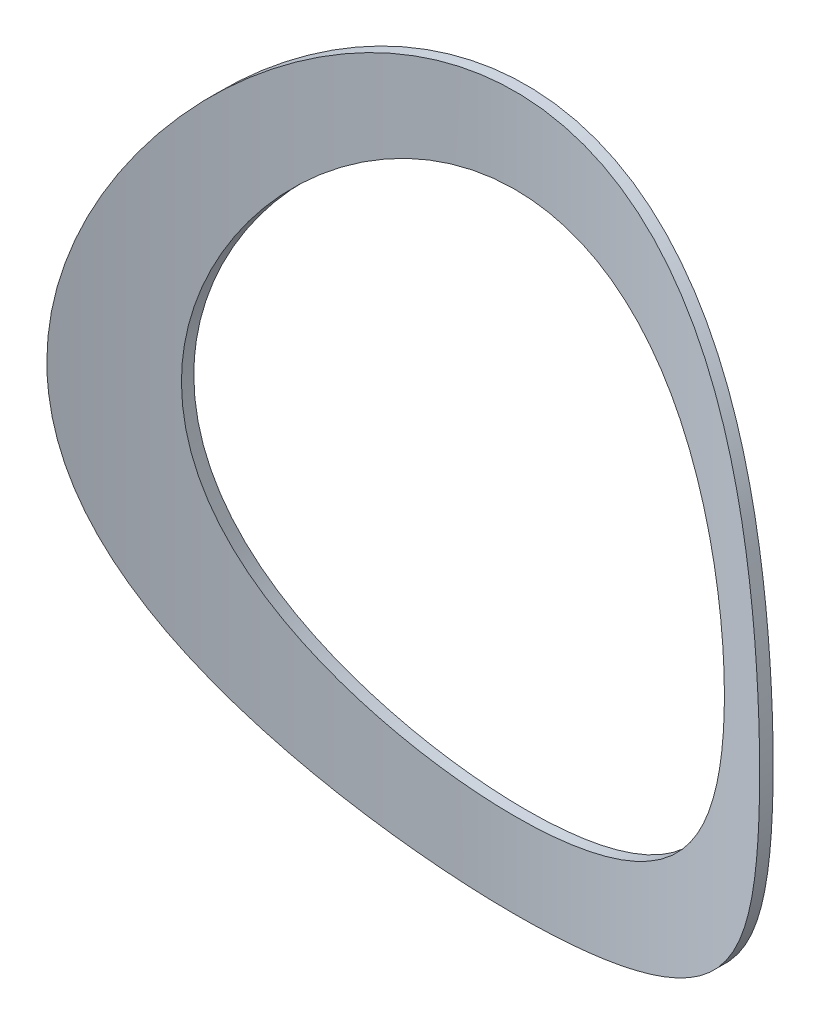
ISO-10303-21;
HEADER;
FILE_DESCRIPTION(('STEP AP214'),'2;1');
FILE_NAME('part.step','',(''),(''),'','','');
FILE_SCHEMA(('AUTOMOTIVE_DESIGN { 1 0 10303 214 1 1 1 1 }'));
ENDSEC;
DATA;
#1=APPLICATION_CONTEXT('core data for automotive mechanical design processes');
#2=APPLICATION_PROTOCOL_DEFINITION('international standard','automotive_design',2000,#1);
#3=PRODUCT_CONTEXT('',#1,'mechanical');
#4=PRODUCT('Part','Part','',(#3));
#5=PRODUCT_RELATED_PRODUCT_CATEGORY('part','',(#4));
#6=PRODUCT_DEFINITION_FORMATION('','',#4);
#7=PRODUCT_DEFINITION_CONTEXT('part definition',#1,'design');
#8=PRODUCT_DEFINITION('design','',#6,#7);
#9=PRODUCT_DEFINITION_SHAPE('','',#8);
#10=(LENGTH_UNIT() NAMED_UNIT(*) SI_UNIT(.MILLI.,.METRE.));
#11=(NAMED_UNIT(*) PLANE_ANGLE_UNIT() SI_UNIT($,.RADIAN.));
#12=(NAMED_UNIT(*) SI_UNIT($,.STERADIAN.) SOLID_ANGLE_UNIT());
#13=UNCERTAINTY_MEASURE_WITH_UNIT(LENGTH_MEASURE(1.E-05),#10,'distance_accuracy_value','');
#14=(GEOMETRIC_REPRESENTATION_CONTEXT(3) GLOBAL_UNCERTAINTY_ASSIGNED_CONTEXT((#13)) GLOBAL_UNIT_ASSIGNED_CONTEXT((#10,
#11,#12)) REPRESENTATION_CONTEXT('',''));
#15=CARTESIAN_POINT('',(0.,0.,0.));
#16=DIRECTION('',(0.,0.,1.));
#17=DIRECTION('',(1.,0.,0.));
#18=AXIS2_PLACEMENT_3D('',#15,#16,#17);
#19=CARTESIAN_POINT('',(0.,-406.4,711.2));
#20=DIRECTION('',(0.,1.,0.));
#21=DIRECTION('',(0.,0.,1.));
#22=AXIS2_PLACEMENT_3D('',#19,#20,#21);
#23=CYLINDRICAL_SURFACE('',#22,711.2);
#24=CARTESIAN_POINT('',(-406.4,0.,127.552435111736));
#25=CARTESIAN_POINT('',(-406.399997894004,5.16978179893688,127.552432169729));
#26=CARTESIAN_POINT('',(-406.30131623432,10.3396231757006,127.483682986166));
#27=CARTESIAN_POINT('',(-405.907003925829,20.6681929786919,127.209416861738));
#28=CARTESIAN_POINT('',(-405.6113700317,25.826921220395,127.003897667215));
#29=CARTESIAN_POINT('',(-404.824379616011,36.1225395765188,126.458270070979));
#30=CARTESIAN_POINT('',(-404.333012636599,41.2594285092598,126.1181544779));
#31=CARTESIAN_POINT('',(-403.156574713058,51.5005106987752,125.306898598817));
#32=CARTESIAN_POINT('',(-402.471504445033,56.6047040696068,124.83575877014));
#33=CARTESIAN_POINT('',(-400.909659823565,66.7749738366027,123.766786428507));
#34=CARTESIAN_POINT('',(-400.03271495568,71.8410121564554,123.168841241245));
#35=CARTESIAN_POINT('',(-398.090749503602,81.9210620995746,121.852419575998));
#36=CARTESIAN_POINT('',(-397.025728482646,86.9350736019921,121.133942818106));
#37=CARTESIAN_POINT('',(-394.711339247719,96.9025057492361,119.583284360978));
#38=CARTESIAN_POINT('',(-393.461971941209,101.855926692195,118.751103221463));
#39=CARTESIAN_POINT('',(-390.782925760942,111.694489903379,116.98057731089));
#40=CARTESIAN_POINT('',(-389.353247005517,116.579632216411,116.042232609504));
#41=CARTESIAN_POINT('',(-386.327851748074,126.242677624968,114.073995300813));
#42=CARTESIAN_POINT('',(-384.733295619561,131.021076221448,113.044749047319));
#43=CARTESIAN_POINT('',(-381.374666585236,140.497671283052,110.897763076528));
#44=CARTESIAN_POINT('',(-379.610593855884,145.195867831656,109.78002345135));
#45=CARTESIAN_POINT('',(-375.917283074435,154.506429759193,107.464639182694));
#46=CARTESIAN_POINT('',(-373.988055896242,159.118800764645,106.266999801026));
#47=CARTESIAN_POINT('',(-369.968321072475,168.253692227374,103.800261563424));
#48=CARTESIAN_POINT('',(-367.877800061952,172.776205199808,102.531156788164));
#49=CARTESIAN_POINT('',(-363.539367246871,181.727345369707,99.9300384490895));
#50=CARTESIAN_POINT('',(-361.291435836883,186.155960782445,98.598017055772));
#51=CARTESIAN_POINT('',(-356.642286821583,194.914911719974,95.8797826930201));
#52=CARTESIAN_POINT('',(-354.241070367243,199.245247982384,94.4935701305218));
#53=CARTESIAN_POINT('',(-349.288884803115,207.804432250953,91.6753179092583));
#54=CARTESIAN_POINT('',(-346.737908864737,212.033275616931,90.2432761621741));
#55=CARTESIAN_POINT('',(-341.489756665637,220.386104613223,87.341701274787));
#56=CARTESIAN_POINT('',(-338.792578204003,224.510088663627,85.8721675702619));
#57=CARTESIAN_POINT('',(-332.951218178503,233.097171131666,82.7407089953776));
#58=CARTESIAN_POINT('',(-329.790476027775,237.547773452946,81.0753790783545));
#59=CARTESIAN_POINT('',(-323.297204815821,246.312042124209,77.7193656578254));
#60=CARTESIAN_POINT('',(-319.964672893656,250.625706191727,76.0286817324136));
#61=CARTESIAN_POINT('',(-313.131733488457,259.112246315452,72.6324516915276));
#62=CARTESIAN_POINT('',(-309.631318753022,263.285116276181,70.9269049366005));
#63=CARTESIAN_POINT('',(-302.466639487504,271.485796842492,67.5113162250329));
#64=CARTESIAN_POINT('',(-298.802375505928,275.513607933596,65.8012742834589));
#65=CARTESIAN_POINT('',(-291.311459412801,283.422436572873,62.3856745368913));
#66=CARTESIAN_POINT('',(-287.484708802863,287.303362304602,60.6801201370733));
#67=CARTESIAN_POINT('',(-279.674705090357,294.911408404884,57.2843853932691));
#68=CARTESIAN_POINT('',(-275.691452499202,298.638529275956,55.5942049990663));
#69=CARTESIAN_POINT('',(-267.57206668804,305.934533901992,52.2387526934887));
#70=CARTESIAN_POINT('',(-263.435926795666,309.503410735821,50.5734818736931));
#71=CARTESIAN_POINT('',(-255.014858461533,316.477917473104,47.2773332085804));
#72=CARTESIAN_POINT('',(-250.729927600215,319.883544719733,45.6464559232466));
#73=CARTESIAN_POINT('',(-241.600991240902,326.842345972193,42.2752860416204));
#74=CARTESIAN_POINT('',(-236.74257306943,330.37874652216,40.5393395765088));
#75=CARTESIAN_POINT('',(-226.858254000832,337.242488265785,37.131679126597));
#76=CARTESIAN_POINT('',(-221.832350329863,340.569825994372,35.4599662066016));
#77=CARTESIAN_POINT('',(-211.619176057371,347.00825267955,32.1922586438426));
#78=CARTESIAN_POINT('',(-206.431890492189,350.119321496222,30.59627105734));
#79=CARTESIAN_POINT('',(-195.903735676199,356.117100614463,27.4915198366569));
#80=CARTESIAN_POINT('',(-190.562867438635,359.003812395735,25.9827556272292));
#81=CARTESIAN_POINT('',(-179.73899220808,364.543264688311,23.0643062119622));
#82=CARTESIAN_POINT('',(-174.25607413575,367.196147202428,21.6545609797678));
#83=CARTESIAN_POINT('',(-163.154061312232,372.261924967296,18.9436585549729));
#84=CARTESIAN_POINT('',(-157.534965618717,374.674818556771,17.6425021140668));
#85=CARTESIAN_POINT('',(-146.171522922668,379.252372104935,15.1589483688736));
#86=CARTESIAN_POINT('',(-140.42719032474,381.417060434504,13.9765374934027));
#87=CARTESIAN_POINT('',(-128.824096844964,385.490746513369,11.7397100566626));
#88=CARTESIAN_POINT('',(-122.965338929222,387.399750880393,10.685290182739));
#89=CARTESIAN_POINT('',(-111.668412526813,390.797614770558,8.80022824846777));
#90=CARTESIAN_POINT('',(-106.238843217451,392.30869648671,7.958044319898));
#91=CARTESIAN_POINT('',(-95.3053762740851,395.107183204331,6.39306178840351));
#92=CARTESIAN_POINT('',(-89.8014800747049,396.394592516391,5.67026088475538));
#93=CARTESIAN_POINT('',(-78.7305854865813,398.741108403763,4.34922987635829));
#94=CARTESIAN_POINT('',(-73.1635891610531,399.80022242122,3.75099571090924));
#95=CARTESIAN_POINT('',(-61.9780792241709,401.686252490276,2.68343639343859));
#96=CARTESIAN_POINT('',(-56.3595654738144,402.513167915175,2.21411158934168));
#97=CARTESIAN_POINT('',(-45.0873217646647,403.931107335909,1.40814362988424));
#98=CARTESIAN_POINT('',(-39.4336187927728,404.522293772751,1.07140910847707));
#99=CARTESIAN_POINT('',(-28.0999546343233,405.467247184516,0.532695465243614));
#100=CARTESIAN_POINT('',(-22.4199933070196,405.821012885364,0.330717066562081));
#101=CARTESIAN_POINT('',(-11.0474489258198,406.28967557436,0.0630627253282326));
#102=CARTESIAN_POINT('',(-5.3548668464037,406.404590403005,-0.00262339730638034));
#103=CARTESIAN_POINT('',(6.02993902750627,406.395129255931,0.00278359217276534));
#104=CARTESIAN_POINT('',(11.7221628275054,406.270759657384,0.073873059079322));
#105=CARTESIAN_POINT('',(22.4504945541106,405.810813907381,0.336534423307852));
#106=CARTESIAN_POINT('',(27.4880732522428,405.500686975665,0.513587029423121));
#107=CARTESIAN_POINT('',(37.5432851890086,404.69358751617,0.973789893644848));
#108=CARTESIAN_POINT('',(42.5609189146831,404.196619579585,1.25693754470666));
#109=CARTESIAN_POINT('',(52.5668704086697,403.017443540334,1.92762296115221));
#110=CARTESIAN_POINT('',(57.5551907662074,402.335252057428,2.31515136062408));
#111=CARTESIAN_POINT('',(67.4943093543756,400.787691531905,3.1923394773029));
#112=CARTESIAN_POINT('',(72.4451073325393,399.922321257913,3.68199988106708));
#113=CARTESIAN_POINT('',(82.3008901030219,398.01095682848,4.76063291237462));
#114=CARTESIAN_POINT('',(87.2058738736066,396.964958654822,5.34960774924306));
#115=CARTESIAN_POINT('',(96.9619506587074,394.695355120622,6.62351629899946));
#116=CARTESIAN_POINT('',(101.813043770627,393.471750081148,7.30844983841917));
#117=CARTESIAN_POINT('',(111.453982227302,390.850260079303,8.77048595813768));
#118=CARTESIAN_POINT('',(116.243825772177,389.452370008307,9.54759124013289));
#119=CARTESIAN_POINT('',(125.755099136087,386.486004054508,11.1897245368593));
#120=CARTESIAN_POINT('',(130.476528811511,384.917527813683,12.0547527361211));
#121=CARTESIAN_POINT('',(139.88554769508,381.599392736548,13.876089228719));
#122=CARTESIAN_POINT('',(144.57247635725,379.848264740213,14.8331319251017));
#123=CARTESIAN_POINT('',(153.863873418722,376.180560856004,16.8269552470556));
#124=CARTESIAN_POINT('',(158.468341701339,374.263984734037,17.863735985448));
#125=CARTESIAN_POINT('',(167.589044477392,370.269708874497,20.0116737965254));
#126=CARTESIAN_POINT('',(172.105280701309,368.192012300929,21.1228294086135));
#127=CARTESIAN_POINT('',(181.044422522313,363.879792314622,23.4139527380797));
#128=CARTESIAN_POINT('',(185.467328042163,361.645268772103,24.5939205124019));
#129=CARTESIAN_POINT('',(194.215812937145,357.023328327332,27.01708315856));
#130=CARTESIAN_POINT('',(198.541375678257,354.635885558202,28.2602887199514));
#131=CARTESIAN_POINT('',(207.09006705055,349.712730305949,30.8037685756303));
#132=CARTESIAN_POINT('',(211.313196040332,347.177018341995,32.1040426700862));
#133=CARTESIAN_POINT('',(219.653294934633,341.961373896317,34.7556061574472));
#134=CARTESIAN_POINT('',(223.770260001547,339.281434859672,36.1068978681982));
#135=CARTESIAN_POINT('',(231.89426076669,333.781477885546,38.8541964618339));
#136=CARTESIAN_POINT('',(235.901294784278,330.961457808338,40.2502040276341));
#137=CARTESIAN_POINT('',(244.248841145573,324.858634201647,43.240601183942));
#138=CARTESIAN_POINT('',(248.575826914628,321.559558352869,44.8395733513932));
#139=CARTESIAN_POINT('',(257.085213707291,314.797850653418,48.0760634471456));
#140=CARTESIAN_POINT('',(261.267612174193,311.335215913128,49.7135820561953));
#141=CARTESIAN_POINT('',(269.484011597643,304.251133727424,53.0180983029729));
#142=CARTESIAN_POINT('',(273.518004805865,300.629678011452,54.685097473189));
#143=CARTESIAN_POINT('',(281.433538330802,293.232784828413,58.0391622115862));
#144=CARTESIAN_POINT('',(285.315079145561,289.457347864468,59.7262277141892));
#145=CARTESIAN_POINT('',(292.92639108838,281.752457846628,63.1128610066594));
#146=CARTESIAN_POINT('',(296.655982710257,277.822832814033,64.812440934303));
#147=CARTESIAN_POINT('',(303.954953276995,269.817873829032,68.212414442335));
#148=CARTESIAN_POINT('',(307.524332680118,265.742540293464,69.9128080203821));
#149=CARTESIAN_POINT('',(314.499269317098,257.450042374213,73.3044847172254));
#150=CARTESIAN_POINT('',(317.90482050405,253.232872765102,74.9957674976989));
#151=CARTESIAN_POINT('',(324.548109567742,244.660763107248,78.3589249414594));
#152=CARTESIAN_POINT('',(327.785844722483,240.305820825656,80.0307992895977));
#153=CARTESIAN_POINT('',(334.40412450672,231.020582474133,83.510062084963));
#154=CARTESIAN_POINT('',(337.766656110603,226.076251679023,85.3143160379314));
#155=CARTESIAN_POINT('',(344.278065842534,216.031017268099,88.8722577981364));
#156=CARTESIAN_POINT('',(347.426940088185,210.930110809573,90.6259446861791));
#157=CARTESIAN_POINT('',(353.505120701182,200.57698045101,94.0681103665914));
#158=CARTESIAN_POINT('',(356.434408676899,195.324743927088,95.7565836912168));
#159=CARTESIAN_POINT('',(362.06694287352,184.674792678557,99.0532697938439));
#160=CARTESIAN_POINT('',(364.770159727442,179.277059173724,100.661472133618));
#161=CARTESIAN_POINT('',(369.939453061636,168.351514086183,103.779766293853));
#162=CARTESIAN_POINT('',(372.405861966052,162.823898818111,105.289994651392));
#163=CARTESIAN_POINT('',(377.098353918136,151.639565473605,108.199259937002));
#164=CARTESIAN_POINT('',(379.324474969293,145.98286798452,109.598314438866));
#165=CARTESIAN_POINT('',(382.477691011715,137.408333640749,111.601963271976));
#166=CARTESIAN_POINT('',(383.497720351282,134.535393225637,112.253992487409));
#167=CARTESIAN_POINT('',(385.474939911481,128.760804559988,113.524593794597));
#168=CARTESIAN_POINT('',(386.432132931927,125.859157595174,114.143167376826));
#169=CARTESIAN_POINT('',(389.208005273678,117.113186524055,115.945900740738));
#170=CARTESIAN_POINT('',(390.931239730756,111.227120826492,117.077240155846));
#171=CARTESIAN_POINT('',(393.750716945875,100.716366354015,118.943318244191));
#172=CARTESIAN_POINT('',(394.900184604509,96.1113878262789,119.70955886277));
#173=CARTESIAN_POINT('',(397.039944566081,86.8494599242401,121.143746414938));
#174=CARTESIAN_POINT('',(398.030243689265,82.1925127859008,121.811697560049));
#175=CARTESIAN_POINT('',(399.848578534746,72.8340173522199,123.04376186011));
#176=CARTESIAN_POINT('',(400.676634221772,68.1324746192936,123.607887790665));
#177=CARTESIAN_POINT('',(402.168001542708,58.6915405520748,124.627621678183));
#178=CARTESIAN_POINT('',(402.831311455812,53.9521488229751,125.083228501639));
#179=CARTESIAN_POINT('',(403.990462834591,44.4473661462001,125.881589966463));
#180=CARTESIAN_POINT('',(404.486439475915,39.6819993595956,126.22443569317));
#181=CARTESIAN_POINT('',(405.309921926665,30.129841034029,126.794696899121));
#182=CARTESIAN_POINT('',(405.637428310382,25.3430495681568,127.022112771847));
#183=CARTESIAN_POINT('',(406.122795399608,15.7565757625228,127.359437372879));
#184=CARTESIAN_POINT('',(406.280650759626,10.9568930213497,127.469342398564));
#185=CARTESIAN_POINT('',(406.426116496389,1.35369007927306,127.570614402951));
#186=CARTESIAN_POINT('',(406.413726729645,-3.44983012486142,127.561981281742));
#187=CARTESIAN_POINT('',(406.218692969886,-13.0544257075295,127.426218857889));
#188=CARTESIAN_POINT('',(406.03595354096,-17.8554982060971,127.299023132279));
#189=CARTESIAN_POINT('',(405.500756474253,-27.4435999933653,126.927219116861));
#190=CARTESIAN_POINT('',(405.148298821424,-32.230629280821,126.682610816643));
#191=CARTESIAN_POINT('',(404.274939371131,-41.7819471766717,126.078221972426));
#192=CARTESIAN_POINT('',(403.754038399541,-46.5462358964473,125.718441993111));
#193=CARTESIAN_POINT('',(402.545613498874,-56.0437799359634,124.886938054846));
#194=CARTESIAN_POINT('',(401.858089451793,-60.7770352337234,124.415214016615));
#195=CARTESIAN_POINT('',(400.318262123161,-70.207471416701,123.363629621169));
#196=CARTESIAN_POINT('',(399.465860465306,-74.9046290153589,122.783704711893));
#197=CARTESIAN_POINT('',(397.599253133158,-84.2526664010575,121.520813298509));
#198=CARTESIAN_POINT('',(396.585047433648,-88.9035461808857,120.837846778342));
#199=CARTESIAN_POINT('',(394.39784289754,-98.1523470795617,119.374423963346));
#200=CARTESIAN_POINT('',(393.224841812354,-102.750267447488,118.593966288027));
#201=CARTESIAN_POINT('',(390.723309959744,-111.886950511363,116.941654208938));
#202=CARTESIAN_POINT('',(389.394778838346,-116.425713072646,116.069799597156));
#203=CARTESIAN_POINT('',(386.568187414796,-125.494353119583,114.229854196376));
#204=CARTESIAN_POINT('',(385.068231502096,-130.023424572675,113.26070537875));
#205=CARTESIAN_POINT('',(381.91598858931,-139.010116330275,111.242401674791));
#206=CARTESIAN_POINT('',(380.263701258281,-143.467736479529,110.193246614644));
#207=CARTESIAN_POINT('',(376.810488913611,-152.306688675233,108.022203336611));
#208=CARTESIAN_POINT('',(375.00957219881,-156.688024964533,106.90031918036));
#209=CARTESIAN_POINT('',(371.262420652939,-165.370902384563,104.59098373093));
#210=CARTESIAN_POINT('',(369.316174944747,-169.67243751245,103.40352753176));
#211=CARTESIAN_POINT('',(365.281475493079,-178.192668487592,100.970178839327));
#212=CARTESIAN_POINT('',(363.192990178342,-182.411345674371,99.7242733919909));
#213=CARTESIAN_POINT('',(358.877530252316,-190.761541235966,97.1815717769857));
#214=CARTESIAN_POINT('',(356.650556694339,-194.893060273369,95.8847759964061));
#215=CARTESIAN_POINT('',(352.061125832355,-203.066222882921,93.2474059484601));
#216=CARTESIAN_POINT('',(349.698660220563,-207.107860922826,91.9068289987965));
#217=CARTESIAN_POINT('',(344.841363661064,-215.098244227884,89.1890522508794));
#218=CARTESIAN_POINT('',(342.346530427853,-219.046987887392,87.8118518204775));
#219=CARTESIAN_POINT('',(336.801527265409,-227.497923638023,84.7962013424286));
#220=CARTESIAN_POINT('',(333.728013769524,-231.982914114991,83.1524019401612));
#221=CARTESIAN_POINT('',(327.409078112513,-240.818932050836,79.8352328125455));
#222=CARTESIAN_POINT('',(324.163651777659,-245.169956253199,78.1618623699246));
#223=CARTESIAN_POINT('',(317.504743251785,-253.734354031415,74.7959645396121));
#224=CARTESIAN_POINT('',(314.091248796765,-257.947717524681,73.1034357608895));
#225=CARTESIAN_POINT('',(307.10032998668,-266.232463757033,69.7096064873));
#226=CARTESIAN_POINT('',(303.52290650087,-270.303847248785,68.0083060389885));
#227=CARTESIAN_POINT('',(296.205030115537,-278.30370105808,64.6056023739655));
#228=CARTESIAN_POINT('',(292.464452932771,-282.232058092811,62.9042001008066));
#229=CARTESIAN_POINT('',(284.826584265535,-289.938282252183,59.5124083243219));
#230=CARTESIAN_POINT('',(280.929293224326,-293.716149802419,57.8220187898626));
#231=CARTESIAN_POINT('',(272.981568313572,-301.117102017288,54.46175832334));
#232=CARTESIAN_POINT('',(268.931128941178,-304.740181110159,52.7918881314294));
#233=CARTESIAN_POINT('',(260.681041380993,-311.826756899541,49.4820917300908));
#234=CARTESIAN_POINT('',(256.481390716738,-315.290250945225,47.8421660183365));
#235=CARTESIAN_POINT('',(247.509112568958,-322.391260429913,44.4392146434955));
#236=CARTESIAN_POINT('',(242.72121518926,-326.011482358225,42.6803022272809));
#237=CARTESIAN_POINT('',(232.975427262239,-333.045832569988,39.2218557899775));
#238=CARTESIAN_POINT('',(228.017533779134,-336.459957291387,37.5223227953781));
#239=CARTESIAN_POINT('',(217.937596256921,-343.075076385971,34.1942272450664));
#240=CARTESIAN_POINT('',(212.815536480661,-346.276050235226,32.565671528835));
#241=CARTESIAN_POINT('',(202.414736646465,-352.456845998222,29.3911726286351));
#242=CARTESIAN_POINT('',(197.135997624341,-355.43666937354,27.8452288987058));
#243=CARTESIAN_POINT('',(186.432732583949,-361.165639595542,24.8479450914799));
#244=CARTESIAN_POINT('',(181.008293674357,-363.91492039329,23.3965501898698));
#245=CARTESIAN_POINT('',(170.019351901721,-369.17677376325,20.598084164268));
#246=CARTESIAN_POINT('',(164.454848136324,-371.689344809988,19.2510137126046));
#247=CARTESIAN_POINT('',(153.196200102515,-376.469496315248,16.6715895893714));
#248=CARTESIAN_POINT('',(147.502069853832,-378.73710311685,15.4392235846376));
#249=CARTESIAN_POINT('',(135.994552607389,-383.019751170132,13.0987226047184));
#250=CARTESIAN_POINT('',(130.181168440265,-385.034798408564,11.9905846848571));
#251=CARTESIAN_POINT('',(118.924896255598,-388.651352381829,9.9922762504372));
#252=CARTESIAN_POINT('',(113.490372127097,-390.273170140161,9.0917054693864));
#253=CARTESIAN_POINT('',(102.541088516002,-393.291918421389,7.40923413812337));
#254=CARTESIAN_POINT('',(97.0263304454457,-394.688852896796,6.62733150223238));
#255=CARTESIAN_POINT('',(85.9276948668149,-397.252852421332,5.18783070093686));
#256=CARTESIAN_POINT('',(80.3438191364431,-398.419923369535,4.53022934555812));
#257=CARTESIAN_POINT('',(69.1185542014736,-400.519898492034,3.34414029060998));
#258=CARTESIAN_POINT('',(63.4771648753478,-401.452802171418,2.81565286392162));
#259=CARTESIAN_POINT('',(52.1534710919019,-403.080227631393,1.89209701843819));
#260=CARTESIAN_POINT('',(46.4711996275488,-403.774923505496,1.49693116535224));
#261=CARTESIAN_POINT('',(35.0745658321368,-404.924110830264,0.842489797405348));
#262=CARTESIAN_POINT('',(29.3602033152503,-405.378600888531,0.583215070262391));
#263=CARTESIAN_POINT('',(17.9132601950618,-406.045492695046,0.202568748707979));
#264=CARTESIAN_POINT('',(12.1806811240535,-406.257914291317,0.0811858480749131));
#265=CARTESIAN_POINT('',(0.71050824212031,-406.4398507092,-0.0227683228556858));
#266=CARTESIAN_POINT('',(-5.02708542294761,-406.409372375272,-0.00534350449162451));
#267=CARTESIAN_POINT('',(-15.8251133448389,-406.123379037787,0.158040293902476));
#268=CARTESIAN_POINT('',(-20.8865096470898,-405.894513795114,0.288777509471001));
#269=CARTESIAN_POINT('',(-30.9932213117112,-405.248096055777,0.657651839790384));
#270=CARTESIAN_POINT('',(-36.0385370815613,-404.830548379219,0.895786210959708));
#271=CARTESIAN_POINT('',(-46.1035187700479,-403.808136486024,1.47800182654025));
#272=CARTESIAN_POINT('',(-51.1231869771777,-403.203289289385,1.82207344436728));
#273=CARTESIAN_POINT('',(-61.1284538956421,-401.808144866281,2.6141297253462));
#274=CARTESIAN_POINT('',(-66.1140523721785,-401.017846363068,3.06211510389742));
#275=CARTESIAN_POINT('',(-76.0425690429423,-399.254191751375,4.05937697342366));
#276=CARTESIAN_POINT('',(-80.9854869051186,-398.280834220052,4.60865425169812));
#277=CARTESIAN_POINT('',(-90.8203736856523,-396.153924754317,5.80533085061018));
#278=CARTESIAN_POINT('',(-95.7123426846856,-395.000373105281,6.45273001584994));
#279=CARTESIAN_POINT('',(-105.437685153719,-392.516297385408,7.84200889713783));
#280=CARTESIAN_POINT('',(-110.271057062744,-391.185768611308,8.58389112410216));
#281=CARTESIAN_POINT('',(-119.871769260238,-388.351350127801,10.158016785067));
#282=CARTESIAN_POINT('',(-124.63910948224,-386.847460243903,10.9902603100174));
#283=CARTESIAN_POINT('',(-134.108202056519,-383.667736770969,12.741948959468));
#284=CARTESIAN_POINT('',(-138.809842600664,-381.991643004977,13.6615258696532));
#285=CARTESIAN_POINT('',(-148.13372417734,-378.473497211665,15.5819325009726));
#286=CARTESIAN_POINT('',(-152.755965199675,-376.631445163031,16.5827622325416));
#287=CARTESIAN_POINT('',(-161.915113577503,-372.785629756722,18.6604794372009));
#288=CARTESIAN_POINT('',(-166.452022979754,-370.781870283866,19.7373650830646));
#289=CARTESIAN_POINT('',(-175.435293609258,-366.616870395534,21.96179014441));
#290=CARTESIAN_POINT('',(-179.88165473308,-364.455629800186,23.1093296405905));
#291=CARTESIAN_POINT('',(-188.679614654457,-359.97961969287,25.4695936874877));
#292=CARTESIAN_POINT('',(-193.031199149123,-357.664827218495,26.6823279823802));
#293=CARTESIAN_POINT('',(-201.634461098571,-352.886266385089,29.1669863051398));
#294=CARTESIAN_POINT('',(-205.886138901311,-350.422498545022,30.4389101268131));
#295=CARTESIAN_POINT('',(-214.285750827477,-345.350038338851,33.0360209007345));
#296=CARTESIAN_POINT('',(-218.433680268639,-342.741339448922,34.3612102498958));
#297=CARTESIAN_POINT('',(-226.621931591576,-337.383165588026,37.0586779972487));
#298=CARTESIAN_POINT('',(-230.662251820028,-334.633688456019,38.4309571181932));
#299=CARTESIAN_POINT('',(-239.069887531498,-328.688137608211,41.3694405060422));
#300=CARTESIAN_POINT('',(-243.424334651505,-325.476192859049,42.9403815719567));
#301=CARTESIAN_POINT('',(-251.99215794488,-318.888873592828,46.1238546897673));
#302=CARTESIAN_POINT('',(-256.20553168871,-315.51349626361,47.7363874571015));
#303=CARTESIAN_POINT('',(-264.487368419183,-308.604075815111,50.9942188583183));
#304=CARTESIAN_POINT('',(-268.555824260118,-305.070024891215,52.6395191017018));
#305=CARTESIAN_POINT('',(-276.543793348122,-297.848084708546,55.953734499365));
#306=CARTESIAN_POINT('',(-280.463307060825,-294.160195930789,57.6226495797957));
#307=CARTESIAN_POINT('',(-288.154059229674,-286.630756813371,60.9767326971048));
#308=CARTESIAN_POINT('',(-291.925126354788,-282.78903867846,62.6619168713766));
#309=CARTESIAN_POINT('',(-299.310689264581,-274.960053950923,66.0372018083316));
#310=CARTESIAN_POINT('',(-302.925185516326,-270.972787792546,67.727302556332));
#311=CARTESIAN_POINT('',(-309.994105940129,-262.856568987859,71.1027919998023));
#312=CARTESIAN_POINT('',(-313.448524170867,-258.727611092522,72.788180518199));
#313=CARTESIAN_POINT('',(-320.193432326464,-250.332022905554,76.1442576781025));
#314=CARTESIAN_POINT('',(-323.483919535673,-246.065390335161,77.8149460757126));
#315=CARTESIAN_POINT('',(-330.233140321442,-236.944096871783,81.305231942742));
#316=CARTESIAN_POINT('',(-333.673367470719,-232.074670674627,83.1220861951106));
#317=CARTESIAN_POINT('',(-340.343410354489,-222.177707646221,86.7112915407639));
#318=CARTESIAN_POINT('',(-343.57322212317,-217.150167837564,88.4836417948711));
#319=CARTESIAN_POINT('',(-349.816737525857,-206.942043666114,91.9694495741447));
#320=CARTESIAN_POINT('',(-352.830422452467,-201.761446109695,93.6829019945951));
#321=CARTESIAN_POINT('',(-358.635402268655,-191.252828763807,97.036075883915));
#322=CARTESIAN_POINT('',(-361.426668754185,-185.924790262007,98.6757879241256));
#323=CARTESIAN_POINT('',(-366.776118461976,-175.13551045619,101.863966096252));
#324=CARTESIAN_POINT('',(-369.334602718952,-169.674453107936,103.412549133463));
#325=CARTESIAN_POINT('',(-374.215126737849,-158.620596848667,106.405264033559));
#326=CARTESIAN_POINT('',(-376.537202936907,-153.027818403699,107.849411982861));
#327=CARTESIAN_POINT('',(-380.937531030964,-141.719306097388,110.617953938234));
#328=CARTESIAN_POINT('',(-383.01583063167,-136.003596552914,111.942371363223));
#329=CARTESIAN_POINT('',(-386.921515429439,-124.458153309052,114.45669086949));
#330=CARTESIAN_POINT('',(-388.748918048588,-118.628427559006,115.646602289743));
#331=CARTESIAN_POINT('',(-391.754635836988,-108.219591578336,117.620864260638));
#332=CARTESIAN_POINT('',(-392.98555771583,-103.66133538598,118.435537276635));
#333=CARTESIAN_POINT('',(-395.291025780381,-94.4897885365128,119.970464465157));
#334=CARTESIAN_POINT('',(-396.365578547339,-89.8765002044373,120.69072261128));
#335=CARTESIAN_POINT('',(-398.355110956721,-80.6018435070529,122.031022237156));
#336=CARTESIAN_POINT('',(-399.270111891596,-75.9404816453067,122.651077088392));
#337=CARTESIAN_POINT('',(-400.937916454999,-66.5760134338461,123.785967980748));
#338=CARTESIAN_POINT('',(-401.690718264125,-61.8729066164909,124.300802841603));
#339=CARTESIAN_POINT('',(-403.031121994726,-52.4363223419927,125.220465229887));
#340=CARTESIAN_POINT('',(-403.618854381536,-47.7028719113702,125.625379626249));
#341=CARTESIAN_POINT('',(-404.627902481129,-38.2099910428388,126.322169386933));
#342=CARTESIAN_POINT('',(-405.049219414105,-33.450560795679,126.614045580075));
#343=CARTESIAN_POINT('',(-405.723977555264,-23.9137406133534,127.082149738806));
#344=CARTESIAN_POINT('',(-405.977405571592,-19.136349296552,127.258368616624));
#345=CARTESIAN_POINT('',(-406.315419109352,-9.57265576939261,127.493513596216));
#346=CARTESIAN_POINT('',(-406.4000019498,-4.78635341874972,127.552437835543));
#347=CARTESIAN_POINT('',(-406.4,0.,127.552435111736));
#348=B_SPLINE_CURVE_WITH_KNOTS('',3,(#24,#25,#26,#27,#28,#29,#30,#31,#32,#33,#34,#35,#36,#37,
#38,#39,#40,#41,#42,#43,#44,#45,#46,#47,#48,#49,#50,#51,#52,#53,#54,#55,#56,#57,#58,#59,#60,#61,
#62,#63,#64,#65,#66,#67,#68,#69,#70,#71,#72,#73,#74,#75,#76,#77,#78,#79,#80,#81,#82,#83,#84,#85,
#86,#87,#88,#89,#90,#91,#92,#93,#94,#95,#96,#97,#98,#99,#100,#101,#102,#103,#104,#105,#106,#107,
#108,#109,#110,#111,#112,#113,#114,#115,#116,#117,#118,#119,#120,#121,#122,#123,#124,#125,#126,
#127,#128,#129,#130,#131,#132,#133,#134,#135,#136,#137,#138,#139,#140,#141,#142,#143,#144,#145,
#146,#147,#148,#149,#150,#151,#152,#153,#154,#155,#156,#157,#158,#159,#160,#161,#162,#163,#164,
#165,#166,#167,#168,#169,#170,#171,#172,#173,#174,#175,#176,#177,#178,#179,#180,#181,#182,#183,
#184,#185,#186,#187,#188,#189,#190,#191,#192,#193,#194,#195,#196,#197,#198,#199,#200,#201,#202,
#203,#204,#205,#206,#207,#208,#209,#210,#211,#212,#213,#214,#215,#216,#217,#218,#219,#220,#221,
#222,#223,#224,#225,#226,#227,#228,#229,#230,#231,#232,#233,#234,#235,#236,#237,#238,#239,#240,
#241,#242,#243,#244,#245,#246,#247,#248,#249,#250,#251,#252,#253,#254,#255,#256,#257,#258,#259,
#260,#261,#262,#263,#264,#265,#266,#267,#268,#269,#270,#271,#272,#273,#274,#275,#276,#277,#278,
#279,#280,#281,#282,#283,#284,#285,#286,#287,#288,#289,#290,#291,#292,#293,#294,#295,#296,#297,
#298,#299,#300,#301,#302,#303,#304,#305,#306,#307,#308,#309,#310,#311,#312,#313,#314,#315,#316,
#317,#318,#319,#320,#321,#322,#323,#324,#325,#326,#327,#328,#329,#330,#331,#332,#333,#334,#335,
#336,#337,#338,#339,#340,#341,#342,#343,#344,#345,#346,#347),.UNSPECIFIED.,.T.,.F.,(4,2,2,2,2,2,
2,2,2,2,2,2,2,2,2,2,2,2,2,2,2,2,2,2,2,2,2,2,2,2,2,2,2,2,2,2,2,2,2,2,2,2,2,2,2,2,2,2,2,2,2,2,2,2,
2,2,2,2,2,2,2,2,2,2,2,2,2,2,2,2,2,2,2,2,2,2,2,2,2,2,2,2,2,2,2,2,2,2,2,2,2,2,2,2,2,2,2,2,2,2,2,2,
2,2,2,2,2,2,2,2,2,2,2,2,2,2,2,2,2,2,2,2,2,2,2,2,2,2,2,2,2,2,2,2,2,2,2,2,2,2,2,2,2,2,2,2,2,2,2,2,
2,2,2,2,2,2,2,2,2,2,2,4),(0.,15.50805451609,31.0163645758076,46.5255033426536,62.0345879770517,
77.5575115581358,93.0804711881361,108.603354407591,124.126227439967,139.546460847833,
154.966678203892,170.385881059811,185.806362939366,201.22876886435,216.651059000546,
232.074052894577,247.497279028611,264.614300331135,281.731606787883,298.849653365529,
315.967642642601,333.096161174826,350.224623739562,367.353834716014,384.483324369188,
403.241986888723,422.000960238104,440.761678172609,459.522272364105,478.27139373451,
497.020644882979,515.767750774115,534.514371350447,551.603922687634,568.693144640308,
585.78180942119,602.870520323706,619.947434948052,637.024441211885,654.100171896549,
671.175447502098,686.321587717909,701.467355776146,716.611765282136,731.756276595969,
746.901124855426,762.04594573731,777.191210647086,792.336507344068,807.614709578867,
822.892933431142,838.170857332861,853.448793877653,868.72932160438,884.009795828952,
899.290965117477,914.572367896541,931.581738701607,948.591410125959,965.601968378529,
982.612471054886,999.642518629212,1016.67251748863,1033.70314444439,1050.73404755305,
1069.46522462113,1088.19674196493,1106.92982643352,1125.66534059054,1144.37415759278,
1163.08001129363,1172.4319613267,1181.78349437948,1200.48423423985,1214.90388190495,
1229.3229115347,1243.74016572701,1258.15757050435,1272.56330052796,1286.96898144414,
1301.3751162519,1315.78126320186,1330.19548583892,1344.60970975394,1359.02386299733,
1373.43802644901,1387.86081697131,1402.28360974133,1416.70660676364,1431.12963661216,
1445.73127168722,1460.3329384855,1474.93379053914,1489.53573648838,1504.14093408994,
1518.7460206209,1533.35200363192,1547.95823891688,1564.99416097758,1582.03049682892,
1599.06807767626,1616.10556819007,1633.15627186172,1650.20692730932,1667.25819599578,
1684.30974781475,1703.06844908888,1721.82747448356,1740.58830354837,1759.34900861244,
1778.0987365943,1796.84858540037,1815.59641586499,1834.34380184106,1851.56505214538,
1868.78599973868,1886.00650532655,1903.22704730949,1920.43497674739,1937.64300593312,
1954.84962407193,1972.05575736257,1987.25594344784,2002.4557412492,2017.65415824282,
2032.85267987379,2048.05131964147,2063.24993533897,2078.44895502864,2093.64799001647,
2108.87033616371,2124.09268426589,2139.31466677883,2154.53666667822,2169.76094805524,
2184.98517640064,2200.21009059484,2215.43523857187,2232.33379619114,2249.2326446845,
2266.13232528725,2283.03195305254,2299.95054564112,2316.86908775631,2333.78825730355,
2350.70770703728,2369.40028570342,2388.09321657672,2406.78776351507,2425.48469403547,
2444.15709135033,2462.82660635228,2481.49246171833,2500.15702028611,2514.52738589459,
2528.89714650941,2543.26498798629,2557.63299062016,2571.98960510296,2586.34611431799,
2600.70375146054,2615.06161657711),.UNSPECIFIED.);
#349=CARTESIAN_POINT('',(-406.4,0.,127.552435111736));
#350=VERTEX_POINT('',#349);
#351=EDGE_CURVE('E62',#350,#350,#348,.T.);
#352=ORIENTED_EDGE('',*,*,#351,.F.);
#353=EDGE_LOOP('',(#352));
#354=FACE_BOUND('',#353,.T.);
#355=CARTESIAN_POINT('',(-309.5625,0.,70.9059280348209));
#356=CARTESIAN_POINT('',(-309.562495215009,-4.11024595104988,70.9059229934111));
#357=CARTESIAN_POINT('',(-309.480608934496,-8.22081804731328,70.8663161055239));
#358=CARTESIAN_POINT('',(-309.153277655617,-16.4344042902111,70.7082178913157));
#359=CARTESIAN_POINT('',(-308.907806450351,-20.5374171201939,70.5897139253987));
#360=CARTESIAN_POINT('',(-308.253851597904,-28.7297470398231,70.2747821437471));
#361=CARTESIAN_POINT('',(-307.845278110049,-32.8190553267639,70.0783113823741));
#362=CARTESIAN_POINT('',(-306.866361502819,-40.9736661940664,69.6091876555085));
#363=CARTESIAN_POINT('',(-306.296025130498,-45.0389697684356,69.3365378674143));
#364=CARTESIAN_POINT('',(-304.993730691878,-53.147588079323,68.7167042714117));
#365=CARTESIAN_POINT('',(-304.261401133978,-57.1908300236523,68.3693491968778));
#366=CARTESIAN_POINT('',(-302.637946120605,-65.238528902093,67.6034502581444));
#367=CARTESIAN_POINT('',(-301.746818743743,-69.2429853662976,67.1849055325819));
#368=CARTESIAN_POINT('',(-299.808341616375,-77.205485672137,66.2802050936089));
#369=CARTESIAN_POINT('',(-298.761016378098,-81.1635366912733,65.7940599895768));
#370=CARTESIAN_POINT('',(-296.512744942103,-89.0272818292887,64.7580739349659));
#371=CARTESIAN_POINT('',(-295.311799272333,-92.9329761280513,64.2082332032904));
#372=CARTESIAN_POINT('',(-292.764765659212,-100.668985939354,63.0517304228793));
#373=CARTESIAN_POINT('',(-291.419331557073,-104.499555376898,62.4453258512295));
#374=CARTESIAN_POINT('',(-288.582139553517,-112.096979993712,61.1783063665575));
#375=CARTESIAN_POINT('',(-287.090381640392,-115.863835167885,60.5176914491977));
#376=CARTESIAN_POINT('',(-283.963760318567,-123.328415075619,59.1471370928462));
#377=CARTESIAN_POINT('',(-282.328900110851,-127.026141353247,58.4371987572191));
#378=CARTESIAN_POINT('',(-278.919152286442,-134.347899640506,56.972983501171));
#379=CARTESIAN_POINT('',(-277.144252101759,-137.971924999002,56.218702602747));
#380=CARTESIAN_POINT('',(-273.458540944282,-145.139943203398,54.6713567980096));
#381=CARTESIAN_POINT('',(-271.547780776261,-148.68396532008,53.8783064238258));
#382=CARTESIAN_POINT('',(-267.59291727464,-155.689281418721,52.2583963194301));
#383=CARTESIAN_POINT('',(-265.548802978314,-159.150568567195,51.4315338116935));
#384=CARTESIAN_POINT('',(-261.330699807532,-165.985949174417,49.7494269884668));
#385=CARTESIAN_POINT('',(-259.156712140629,-169.360043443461,48.8941829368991));
#386=CARTESIAN_POINT('',(-254.682178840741,-176.017083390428,47.1607058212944));
#387=CARTESIAN_POINT('',(-252.38163470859,-179.300030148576,46.2824730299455));
#388=CARTESIAN_POINT('',(-247.511237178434,-185.971024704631,44.4535675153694));
#389=CARTESIAN_POINT('',(-244.933526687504,-189.35303159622,43.5017719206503));
#390=CARTESIAN_POINT('',(-239.642975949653,-196.005734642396,41.5847371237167));
#391=CARTESIAN_POINT('',(-236.930134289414,-199.276429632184,40.6194977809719));
#392=CARTESIAN_POINT('',(-231.373189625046,-205.702288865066,38.6819366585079));
#393=CARTESIAN_POINT('',(-228.5290839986,-208.857450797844,37.709614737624));
#394=CARTESIAN_POINT('',(-222.713543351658,-215.048030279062,35.7642007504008));
#395=CARTESIAN_POINT('',(-219.74210592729,-218.08344556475,34.7911086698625));
#396=CARTESIAN_POINT('',(-213.674648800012,-224.031564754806,32.8499914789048));
#397=CARTESIAN_POINT('',(-210.578576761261,-226.944216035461,31.8819686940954));
#398=CARTESIAN_POINT('',(-204.267385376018,-232.64102450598,29.9576365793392));
#399=CARTESIAN_POINT('',(-201.052276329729,-235.425192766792,29.0013262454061));
#400=CARTESIAN_POINT('',(-194.506598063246,-240.861425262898,27.1062684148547));
#401=CARTESIAN_POINT('',(-191.176016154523,-243.513474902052,26.1675228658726));
#402=CARTESIAN_POINT('',(-184.404409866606,-248.680703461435,24.31371000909));
#403=CARTESIAN_POINT('',(-180.963395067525,-251.195894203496,23.3986406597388));
#404=CARTESIAN_POINT('',(-173.80646726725,-256.203507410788,21.5543966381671));
#405=CARTESIAN_POINT('',(-170.085303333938,-258.688966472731,20.6266743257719));
#406=CARTESIAN_POINT('',(-162.531895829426,-263.500237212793,18.8100004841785));
#407=CARTESIAN_POINT('',(-158.699651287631,-265.826047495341,17.9210492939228));
#408=CARTESIAN_POINT('',(-150.929857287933,-270.313237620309,16.1881571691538));
#409=CARTESIAN_POINT('',(-146.992302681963,-272.474609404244,15.3442184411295));
#410=CARTESIAN_POINT('',(-139.018447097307,-276.627946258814,13.7074363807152));
#411=CARTESIAN_POINT('',(-134.982146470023,-278.619911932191,12.9145928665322));
#412=CARTESIAN_POINT('',(-126.819085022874,-282.428999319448,11.3860275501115));
#413=CARTESIAN_POINT('',(-122.692357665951,-284.246184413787,10.6502850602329));
#414=CARTESIAN_POINT('',(-114.354296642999,-287.70193325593,9.24101846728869));
#415=CARTESIAN_POINT('',(-110.142962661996,-289.340496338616,8.56749459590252));
#416=CARTESIAN_POINT('',(-101.643763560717,-292.434501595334,7.28775226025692));
#417=CARTESIAN_POINT('',(-97.3559030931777,-293.889954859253,6.6815297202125));
#418=CARTESIAN_POINT('',(-88.7117393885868,-296.613726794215,5.5409664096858));
#419=CARTESIAN_POINT('',(-84.3554371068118,-297.88204807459,5.00662463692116));
#420=CARTESIAN_POINT('',(-75.829613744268,-300.161913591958,4.04183705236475));
#421=CARTESIAN_POINT('',(-71.6633462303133,-301.183879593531,3.60724119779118));
#422=CARTESIAN_POINT('',(-63.2854740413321,-303.054965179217,2.80879847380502));
#423=CARTESIAN_POINT('',(-59.0738698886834,-303.904086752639,2.44495079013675));
#424=CARTESIAN_POINT('',(-50.6135239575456,-305.427055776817,1.79058920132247));
#425=CARTESIAN_POINT('',(-46.3647830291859,-306.100907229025,1.50007362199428));
#426=CARTESIAN_POINT('',(-37.8384760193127,-307.271391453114,0.994446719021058));
#427=CARTESIAN_POINT('',(-33.5609098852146,-307.768023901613,0.779335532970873));
#428=CARTESIAN_POINT('',(-24.9872369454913,-308.582428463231,0.426140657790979));
#429=CARTESIAN_POINT('',(-20.6911377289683,-308.900267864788,0.288027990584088));
#430=CARTESIAN_POINT('',(-12.0876048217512,-309.356409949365,0.0897098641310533));
#431=CARTESIAN_POINT('',(-7.78017109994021,-309.494712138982,0.0295046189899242));
#432=CARTESIAN_POINT('',(0.836932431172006,-309.591353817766,-0.0125583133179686));
#433=CARTESIAN_POINT('',(5.14660215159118,-309.549699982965,0.00558109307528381));
#434=CARTESIAN_POINT('',(13.7593676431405,-309.286570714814,0.120069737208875));
#435=CARTESIAN_POINT('',(18.0624635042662,-309.065097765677,0.216417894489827));
#436=CARTESIAN_POINT('',(26.3678546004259,-308.46368226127,0.477639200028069));
#437=CARTESIAN_POINT('',(30.3711452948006,-308.09524238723,0.637535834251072));
#438=CARTESIAN_POINT('',(38.3571337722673,-307.203213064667,1.02385919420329));
#439=CARTESIAN_POINT('',(42.3398318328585,-306.67962571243,1.25028502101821));
#440=CARTESIAN_POINT('',(50.2774824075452,-305.47868610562,1.76823239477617));
#441=CARTESIAN_POINT('',(54.2324363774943,-304.801341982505,2.05975049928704));
#442=CARTESIAN_POINT('',(62.1080581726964,-303.294583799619,2.70607619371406));
#443=CARTESIAN_POINT('',(66.0287258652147,-302.465169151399,3.06088402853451));
#444=CARTESIAN_POINT('',(73.8293183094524,-300.656288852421,3.83161423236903));
#445=CARTESIAN_POINT('',(77.7092419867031,-299.676819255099,4.24753820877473));
#446=CARTESIAN_POINT('',(85.4219576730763,-297.570179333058,5.1379637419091));
#447=CARTESIAN_POINT('',(89.2547497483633,-296.44300921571,5.61246521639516));
#448=CARTESIAN_POINT('',(96.8673034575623,-294.043524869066,6.61721127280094));
#449=CARTESIAN_POINT('',(100.647063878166,-292.771207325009,7.14745712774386));
#450=CARTESIAN_POINT('',(108.14777949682,-290.084245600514,8.26054809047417));
#451=CARTESIAN_POINT('',(111.868734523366,-288.66960100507,8.84339335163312));
#452=CARTESIAN_POINT('',(119.302649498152,-285.678342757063,10.0675420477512));
#453=CARTESIAN_POINT('',(123.014624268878,-284.099590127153,10.7096007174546));
#454=CARTESIAN_POINT('',(130.367095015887,-280.801702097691,12.0406344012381));
#455=CARTESIAN_POINT('',(134.00759080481,-279.082566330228,12.7296095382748));
#456=CARTESIAN_POINT('',(141.212071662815,-275.507284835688,14.1504524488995));
#457=CARTESIAN_POINT('',(144.776057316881,-273.65114015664,14.8823198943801));
#458=CARTESIAN_POINT('',(151.822846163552,-269.805257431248,16.3847423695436));
#459=CARTESIAN_POINT('',(155.305649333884,-267.815519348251,17.1552974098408));
#460=CARTESIAN_POINT('',(162.186601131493,-263.70535185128,18.7309338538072));
#461=CARTESIAN_POINT('',(165.584726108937,-261.584886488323,19.5360247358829));
#462=CARTESIAN_POINT('',(172.291140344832,-257.217257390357,21.176000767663));
#463=CARTESIAN_POINT('',(175.599429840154,-254.970093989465,22.010885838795));
#464=CARTESIAN_POINT('',(182.122355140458,-250.352466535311,23.7058228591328));
#465=CARTESIAN_POINT('',(185.336987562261,-247.981998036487,24.5658757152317));
#466=CARTESIAN_POINT('',(191.668745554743,-243.121293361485,26.3063494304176));
#467=CARTESIAN_POINT('',(194.785869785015,-240.631055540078,27.18677056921));
#468=CARTESIAN_POINT('',(201.151982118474,-235.340660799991,29.0305783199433));
#469=CARTESIAN_POINT('',(204.392999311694,-232.531331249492,29.9951867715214));
#470=CARTESIAN_POINT('',(210.75365923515,-226.782306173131,31.9361396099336));
#471=CARTESIAN_POINT('',(213.873300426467,-223.842608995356,32.9124841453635));
#472=CARTESIAN_POINT('',(219.987012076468,-217.837133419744,34.8705998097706));
#473=CARTESIAN_POINT('',(222.981082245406,-214.771354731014,35.8523709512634));
#474=CARTESIAN_POINT('',(228.839771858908,-208.517767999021,37.8150107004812));
#475=CARTESIAN_POINT('',(231.704381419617,-205.329950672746,38.7958792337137));
#476=CARTESIAN_POINT('',(237.301009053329,-198.835497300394,40.7505532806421));
#477=CARTESIAN_POINT('',(240.032972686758,-195.528813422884,41.7243557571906));
#478=CARTESIAN_POINT('',(245.359044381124,-188.802235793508,43.6579368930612));
#479=CARTESIAN_POINT('',(247.953152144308,-185.382341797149,44.6177155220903));
#480=CARTESIAN_POINT('',(252.999634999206,-178.433642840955,46.516696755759));
#481=CARTESIAN_POINT('',(255.452001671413,-174.904831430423,47.4558981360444));
#482=CARTESIAN_POINT('',(260.210586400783,-167.743473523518,49.3069511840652));
#483=CARTESIAN_POINT('',(262.516816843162,-164.110935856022,50.2188051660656));
#484=CARTESIAN_POINT('',(267.065874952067,-156.603837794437,52.0433454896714));
#485=CARTESIAN_POINT('',(269.302772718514,-152.725355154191,52.9546919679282));
#486=CARTESIAN_POINT('',(273.610164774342,-144.867164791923,54.7334375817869));
#487=CARTESIAN_POINT('',(275.68065786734,-140.887456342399,55.6008364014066));
#488=CARTESIAN_POINT('',(279.650755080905,-132.832815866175,57.2844512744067));
#489=CARTESIAN_POINT('',(281.550351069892,-128.757879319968,58.1006648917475));
#490=CARTESIAN_POINT('',(285.174003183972,-120.519620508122,59.6747660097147));
#491=CARTESIAN_POINT('',(286.898059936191,-116.356298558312,60.4326537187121));
#492=CARTESIAN_POINT('',(290.165166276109,-107.951076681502,61.8828132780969));
#493=CARTESIAN_POINT('',(291.708329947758,-103.709228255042,62.5751264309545));
#494=CARTESIAN_POINT('',(294.610651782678,-95.1520733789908,63.8882193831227));
#495=CARTESIAN_POINT('',(295.969809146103,-90.83676661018,64.5089988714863));
#496=CARTESIAN_POINT('',(298.499983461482,-82.1413571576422,65.6729755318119));
#497=CARTESIAN_POINT('',(299.671015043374,-77.7612595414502,66.2161787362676));
#498=CARTESIAN_POINT('',(301.82135903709,-68.9448737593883,67.2196309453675));
#499=CARTESIAN_POINT('',(302.800674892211,-64.5085866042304,67.6798814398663));
#500=CARTESIAN_POINT('',(304.503599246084,-55.8964886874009,68.484027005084));
#501=CARTESIAN_POINT('',(305.240173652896,-51.7237814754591,68.8337526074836));
#502=CARTESIAN_POINT('',(306.542075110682,-43.3459072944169,69.4540092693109));
#503=CARTESIAN_POINT('',(307.107404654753,-39.1407407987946,69.7245414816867));
#504=CARTESIAN_POINT('',(308.06503942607,-30.7064471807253,70.1838897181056));
#505=CARTESIAN_POINT('',(308.457350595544,-26.4773208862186,70.3727085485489));
#506=CARTESIAN_POINT('',(309.067720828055,-18.0035939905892,70.6668635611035));
#507=CARTESIAN_POINT('',(309.285779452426,-13.7589933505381,70.7721995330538));
#508=CARTESIAN_POINT('',(309.546885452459,-5.26463600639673,70.8983626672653));
#509=CARTESIAN_POINT('',(309.589993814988,-1.01488161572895,70.9192192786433));
#510=CARTESIAN_POINT('',(309.501224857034,7.48238408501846,70.8763051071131));
#511=CARTESIAN_POINT('',(309.369347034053,11.7298953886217,70.8125340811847));
#512=CARTESIAN_POINT('',(308.9310456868,20.2136483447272,70.6009771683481));
#513=CARTESIAN_POINT('',(308.624627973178,24.4498903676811,70.4531940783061));
#514=CARTESIAN_POINT('',(307.838243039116,32.9024791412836,70.0750148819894));
#515=CARTESIAN_POINT('',(307.358278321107,37.1188261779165,69.8446199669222));
#516=CARTESIAN_POINT('',(306.267552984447,45.2170709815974,69.3230934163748));
#517=CARTESIAN_POINT('',(305.668861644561,49.1009656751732,69.0376061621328));
#518=CARTESIAN_POINT('',(304.325194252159,56.8377779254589,68.3997438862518));
#519=CARTESIAN_POINT('',(303.5802203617,60.6906959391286,68.0473698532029));
#520=CARTESIAN_POINT('',(301.945935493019,68.3590626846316,67.2784929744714));
#521=CARTESIAN_POINT('',(301.056633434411,72.1745137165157,66.8619940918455));
#522=CARTESIAN_POINT('',(299.135828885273,79.7622290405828,65.9680123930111));
#523=CARTESIAN_POINT('',(298.104325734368,83.5344931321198,65.4905292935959));
#524=CARTESIAN_POINT('',(295.901338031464,91.0307870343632,64.4780290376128));
#525=CARTESIAN_POINT('',(294.729829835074,94.7548085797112,63.9430021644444));
#526=CARTESIAN_POINT('',(292.249559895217,102.148623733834,62.8193339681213));
#527=CARTESIAN_POINT('',(290.940798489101,105.818417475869,62.2306927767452));
#528=CARTESIAN_POINT('',(288.188694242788,113.098910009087,61.0038864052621));
#529=CARTESIAN_POINT('',(286.745346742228,116.709606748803,60.3657195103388));
#530=CARTESIAN_POINT('',(283.726914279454,123.867127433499,59.0441963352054));
#531=CARTESIAN_POINT('',(282.151827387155,127.413950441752,58.3608393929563));
#532=CARTESIAN_POINT('',(278.800655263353,134.593887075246,56.9224564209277));
#533=CARTESIAN_POINT('',(277.018775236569,138.223929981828,56.1655998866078));
#534=CARTESIAN_POINT('',(273.317903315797,145.404887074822,54.6127701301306));
#535=CARTESIAN_POINT('',(271.398910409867,148.955800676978,53.8167966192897));
#536=CARTESIAN_POINT('',(267.427224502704,155.973964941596,52.1911051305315));
#537=CARTESIAN_POINT('',(265.374535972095,159.441218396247,51.3613882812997));
#538=CARTESIAN_POINT('',(261.138567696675,166.288297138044,49.6735177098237));
#539=CARTESIAN_POINT('',(258.955277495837,169.668115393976,48.8153617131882));
#540=CARTESIAN_POINT('',(254.460926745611,176.337038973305,47.0758515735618));
#541=CARTESIAN_POINT('',(252.14982952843,179.626117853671,46.1944908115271));
#542=CARTESIAN_POINT('',(247.403519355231,186.109055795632,44.4141548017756));
#543=CARTESIAN_POINT('',(244.968294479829,189.302905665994,43.5151778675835));
#544=CARTESIAN_POINT('',(239.977240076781,195.591357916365,41.7051077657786));
#545=CARTESIAN_POINT('',(237.421411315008,198.685960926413,40.7940146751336));
#546=CARTESIAN_POINT('',(232.192425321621,204.772351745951,38.9650785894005));
#547=CARTESIAN_POINT('',(229.519267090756,207.764138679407,38.047235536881));
#548=CARTESIAN_POINT('',(223.811722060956,213.907429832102,36.126951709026));
#549=CARTESIAN_POINT('',(220.766541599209,217.048873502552,35.1243746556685));
#550=CARTESIAN_POINT('',(214.545194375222,223.200440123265,33.1244327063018));
#551=CARTESIAN_POINT('',(211.369037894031,226.210573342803,32.1270674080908));
#552=CARTESIAN_POINT('',(204.889598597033,232.095561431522,30.1440756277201));
#553=CARTESIAN_POINT('',(201.586302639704,234.970402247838,29.1584503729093));
#554=CARTESIAN_POINT('',(194.857492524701,240.579892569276,27.2056506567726));
#555=CARTESIAN_POINT('',(191.431978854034,243.314542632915,26.2384761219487));
#556=CARTESIAN_POINT('',(184.462947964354,248.639489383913,24.3288941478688));
#557=CARTESIAN_POINT('',(180.919412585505,251.229763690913,23.386490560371));
#558=CARTESIAN_POINT('',(173.719847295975,256.260887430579,21.5329268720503));
#559=CARTESIAN_POINT('',(170.063817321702,258.701736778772,20.62176678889));
#560=CARTESIAN_POINT('',(162.644607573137,263.42934793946,18.8368519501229));
#561=CARTESIAN_POINT('',(158.88142914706,265.716111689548,17.9630967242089));
#562=CARTESIAN_POINT('',(151.25351240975,270.130959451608,16.2589326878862));
#563=CARTESIAN_POINT('',(147.388774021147,272.25904334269,15.4285239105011));
#564=CARTESIAN_POINT('',(139.538371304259,276.365217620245,13.8115520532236));
#565=CARTESIAN_POINT('',(135.552085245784,278.342245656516,13.025308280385));
#566=CARTESIAN_POINT('',(127.48928667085,282.126310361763,11.5081041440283));
#567=CARTESIAN_POINT('',(123.412774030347,283.933346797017,10.7771438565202));
#568=CARTESIAN_POINT('',(115.176441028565,287.373008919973,9.37575008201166));
#569=CARTESIAN_POINT('',(111.016618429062,289.005629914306,8.70531822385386));
#570=CARTESIAN_POINT('',(102.621289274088,292.09213295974,7.42991140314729));
#571=CARTESIAN_POINT('',(98.3857828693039,293.546015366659,6.82493631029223));
#572=CARTESIAN_POINT('',(89.8493373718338,296.270316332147,5.68524547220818));
#573=CARTESIAN_POINT('',(85.5484341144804,297.540831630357,5.15049269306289));
#574=CARTESIAN_POINT('',(76.8874467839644,299.895650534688,4.15490870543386));
#575=CARTESIAN_POINT('',(72.5273624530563,300.979953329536,3.69407781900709));
#576=CARTESIAN_POINT('',(63.7572566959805,302.959007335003,2.84990457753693));
#577=CARTESIAN_POINT('',(59.3472386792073,303.853771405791,2.46655696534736));
#578=CARTESIAN_POINT('',(50.4863457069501,305.451036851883,1.78029765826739));
#579=CARTESIAN_POINT('',(46.0354714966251,306.153541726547,1.47738449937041));
#580=CARTESIAN_POINT('',(37.4381059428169,307.318578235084,0.974012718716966));
#581=CARTESIAN_POINT('',(33.2938639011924,307.795171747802,0.767567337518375));
#582=CARTESIAN_POINT('',(24.9865919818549,308.580650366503,0.426906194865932));
#583=CARTESIAN_POINT('',(20.8235624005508,308.889538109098,0.292689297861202));
#584=CARTESIAN_POINT('',(12.4868939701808,309.338719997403,0.09740444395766));
#585=CARTESIAN_POINT('',(8.31325560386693,309.479021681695,0.0363332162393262));
#586=CARTESIAN_POINT('',(-0.0367261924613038,309.590655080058,-0.0122536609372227));
#587=CARTESIAN_POINT('',(-4.2130696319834,309.561986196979,0.000230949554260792));
#588=CARTESIAN_POINT('',(-12.5595347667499,309.335780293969,0.0986617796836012));
#589=CARTESIAN_POINT('',(-16.7296574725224,309.138274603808,0.18459437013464));
#590=CARTESIAN_POINT('',(-25.0563778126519,308.575002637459,0.429315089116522));
#591=CARTESIAN_POINT('',(-29.2129754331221,308.209236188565,0.588103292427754));
#592=CARTESIAN_POINT('',(-37.5046174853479,307.31048601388,0.977450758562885));
#593=CARTESIAN_POINT('',(-41.63966214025,306.777504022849,1.20800927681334));
#594=CARTESIAN_POINT('',(-49.8804202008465,305.545809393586,1.73933757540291));
#595=CARTESIAN_POINT('',(-53.9861338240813,304.847097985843,2.04010683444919));
#596=CARTESIAN_POINT('',(-61.9913838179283,303.318184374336,2.69596819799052));
#597=CARTESIAN_POINT('',(-65.8924180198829,302.494624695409,3.04829531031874));
#598=CARTESIAN_POINT('',(-73.6541221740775,300.698983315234,3.81345966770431));
#599=CARTESIAN_POINT('',(-77.5147924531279,299.726902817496,4.22629642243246));
#600=CARTESIAN_POINT('',(-85.1894415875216,297.636552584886,5.10997811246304));
#601=CARTESIAN_POINT('',(-89.0034223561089,296.518288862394,5.58082066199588));
#602=CARTESIAN_POINT('',(-96.5789628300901,294.13807818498,6.57773252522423));
#603=CARTESIAN_POINT('',(-100.340522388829,292.876130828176,7.10380199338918));
#604=CARTESIAN_POINT('',(-107.806001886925,290.211161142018,8.20814659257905));
#605=CARTESIAN_POINT('',(-111.509915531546,288.808123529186,8.78642737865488));
#606=CARTESIAN_POINT('',(-118.854363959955,285.864012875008,9.99180778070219));
#607=CARTESIAN_POINT('',(-122.494898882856,284.322940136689,10.6189072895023));
#608=CARTESIAN_POINT('',(-129.70770355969,281.10575823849,11.9183825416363));
#609=CARTESIAN_POINT('',(-133.279971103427,279.429644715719,12.5907597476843));
#610=CARTESIAN_POINT('',(-140.351410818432,275.94557299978,13.9770057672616));
#611=CARTESIAN_POINT('',(-143.850582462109,274.137613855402,14.6908748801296));
#612=CARTESIAN_POINT('',(-150.929688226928,270.307415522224,16.189675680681));
#613=CARTESIAN_POINT('',(-154.505994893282,268.27915752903,16.9763642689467));
#614=CARTESIAN_POINT('',(-161.569020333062,264.085708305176,18.5861020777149));
#615=CARTESIAN_POINT('',(-165.055738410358,261.920516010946,19.409151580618));
#616=CARTESIAN_POINT('',(-171.935113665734,257.456929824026,21.0867542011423));
#617=CARTESIAN_POINT('',(-175.327769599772,255.158534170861,21.9413077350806));
#618=CARTESIAN_POINT('',(-182.014710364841,250.4323257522,23.6768969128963));
#619=CARTESIAN_POINT('',(-185.308995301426,248.004513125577,24.557932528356));
#620=CARTESIAN_POINT('',(-191.796113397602,243.022474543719,26.3416128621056));
#621=CARTESIAN_POINT('',(-194.988916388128,240.468211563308,27.2442638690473));
#622=CARTESIAN_POINT('',(-201.268434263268,235.237451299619,29.0657420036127));
#623=CARTESIAN_POINT('',(-204.355140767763,232.560944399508,29.9845704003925));
#624=CARTESIAN_POINT('',(-210.418487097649,227.089578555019,31.83298166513));
#625=CARTESIAN_POINT('',(-213.395126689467,224.294719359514,32.7625645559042));
#626=CARTESIAN_POINT('',(-219.234676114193,218.590389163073,34.6270245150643));
#627=CARTESIAN_POINT('',(-222.097586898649,215.68091912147,35.5619015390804));
#628=CARTESIAN_POINT('',(-227.917453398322,209.527645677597,37.5018642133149));
#629=CARTESIAN_POINT('',(-230.865249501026,206.275166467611,38.5069340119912));
#630=CARTESIAN_POINT('',(-236.620956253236,199.646516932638,40.509871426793));
#631=CARTESIAN_POINT('',(-239.428865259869,196.270345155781,41.5077389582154));
#632=CARTESIAN_POINT('',(-244.900603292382,189.398854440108,43.4892829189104));
#633=CARTESIAN_POINT('',(-247.564424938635,185.903529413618,44.472958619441));
#634=CARTESIAN_POINT('',(-252.74356815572,178.798647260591,46.4189970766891));
#635=CARTESIAN_POINT('',(-255.258886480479,175.189087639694,47.3813593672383));
#636=CARTESIAN_POINT('',(-260.138348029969,167.858221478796,49.2783000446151));
#637=CARTESIAN_POINT('',(-262.502383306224,164.136837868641,50.2128583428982));
#638=CARTESIAN_POINT('',(-267.072743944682,156.590383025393,52.0462610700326));
#639=CARTESIAN_POINT('',(-269.279084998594,152.765322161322,52.9451090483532));
#640=CARTESIAN_POINT('',(-273.529921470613,145.016725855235,54.7001067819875));
#641=CARTESIAN_POINT('',(-275.574417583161,141.093190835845,55.5562567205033));
#642=CARTESIAN_POINT('',(-279.497187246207,133.153557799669,57.2188834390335));
#643=CARTESIAN_POINT('',(-281.375461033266,129.137459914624,58.02536028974));
#644=CARTESIAN_POINT('',(-284.962370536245,121.016944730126,59.5822345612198));
#645=CARTESIAN_POINT('',(-286.670917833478,116.912482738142,60.3326027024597));
#646=CARTESIAN_POINT('',(-289.913004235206,108.62409176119,61.7702232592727));
#647=CARTESIAN_POINT('',(-291.446542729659,104.440162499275,62.457475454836));
#648=CARTESIAN_POINT('',(-294.334763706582,95.9994210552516,63.7627449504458));
#649=CARTESIAN_POINT('',(-295.689411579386,91.7425949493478,64.3807488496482));
#650=CARTESIAN_POINT('',(-298.215587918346,83.1648582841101,65.5415486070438));
#651=CARTESIAN_POINT('',(-299.38711908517,78.8439486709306,66.0843455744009));
#652=CARTESIAN_POINT('',(-301.540270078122,70.1595370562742,67.0879658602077));
#653=CARTESIAN_POINT('',(-302.522448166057,65.7962013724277,67.5490298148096));
#654=CARTESIAN_POINT('',(-304.298129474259,57.0229835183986,68.3866113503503));
#655=CARTESIAN_POINT('',(-305.091623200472,52.6130990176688,68.763124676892));
#656=CARTESIAN_POINT('',(-306.486722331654,43.7595781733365,69.4275126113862));
#657=CARTESIAN_POINT('',(-307.088457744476,39.3159667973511,69.7154472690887));
#658=CARTESIAN_POINT('',(-308.098589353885,30.4024863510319,70.1999886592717));
#659=CARTESIAN_POINT('',(-308.507023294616,25.9326225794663,70.3966132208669));
#660=CARTESIAN_POINT('',(-308.942101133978,19.6703129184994,70.6063415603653));
#661=CARTESIAN_POINT('',(-309.050623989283,17.8844944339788,70.6586960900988));
#662=CARTESIAN_POINT('',(-309.23669160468,14.3111729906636,70.7485032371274));
#663=CARTESIAN_POINT('',(-309.314242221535,12.5236704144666,70.7859586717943));
#664=CARTESIAN_POINT('',(-309.43834416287,8.94729760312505,70.8459136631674));
#665=CARTESIAN_POINT('',(-309.484894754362,7.15842733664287,70.8684128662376));
#666=CARTESIAN_POINT('',(-309.54697655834,3.57972540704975,70.8984225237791));
#667=CARTESIAN_POINT('',(-309.562502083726,1.78989362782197,70.9059302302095));
#668=CARTESIAN_POINT('',(-309.5625,0.,70.9059280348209));
#669=B_SPLINE_CURVE_WITH_KNOTS('',3,(#355,#356,#357,#358,#359,#360,#361,#362,#363,#364,#365,
#366,#367,#368,#369,#370,#371,#372,#373,#374,#375,#376,#377,#378,#379,#380,#381,#382,#383,#384,
#385,#386,#387,#388,#389,#390,#391,#392,#393,#394,#395,#396,#397,#398,#399,#400,#401,#402,#403,
#404,#405,#406,#407,#408,#409,#410,#411,#412,#413,#414,#415,#416,#417,#418,#419,#420,#421,#422,
#423,#424,#425,#426,#427,#428,#429,#430,#431,#432,#433,#434,#435,#436,#437,#438,#439,#440,#441,
#442,#443,#444,#445,#446,#447,#448,#449,#450,#451,#452,#453,#454,#455,#456,#457,#458,#459,#460,
#461,#462,#463,#464,#465,#466,#467,#468,#469,#470,#471,#472,#473,#474,#475,#476,#477,#478,#479,
#480,#481,#482,#483,#484,#485,#486,#487,#488,#489,#490,#491,#492,#493,#494,#495,#496,#497,#498,
#499,#500,#501,#502,#503,#504,#505,#506,#507,#508,#509,#510,#511,#512,#513,#514,#515,#516,#517,
#518,#519,#520,#521,#522,#523,#524,#525,#526,#527,#528,#529,#530,#531,#532,#533,#534,#535,#536,
#537,#538,#539,#540,#541,#542,#543,#544,#545,#546,#547,#548,#549,#550,#551,#552,#553,#554,#555,
#556,#557,#558,#559,#560,#561,#562,#563,#564,#565,#566,#567,#568,#569,#570,#571,#572,#573,#574,
#575,#576,#577,#578,#579,#580,#581,#582,#583,#584,#585,#586,#587,#588,#589,#590,#591,#592,#593,
#594,#595,#596,#597,#598,#599,#600,#601,#602,#603,#604,#605,#606,#607,#608,#609,#610,#611,#612,
#613,#614,#615,#616,#617,#618,#619,#620,#621,#622,#623,#624,#625,#626,#627,#628,#629,#630,#631,
#632,#633,#634,#635,#636,#637,#638,#639,#640,#641,#642,#643,#644,#645,#646,#647,#648,#649,#650,
#651,#652,#653,#654,#655,#656,#657,#658,#659,#660,#661,#662,#663,#664,#665,#666,#667,#668),
.UNSPECIFIED.,.T.,.F.,(4,2,2,2,2,2,2,2,2,2,2,2,2,2,2,2,2,2,2,2,2,2,2,2,2,2,2,2,2,2,2,2,2,2,2,2,
2,2,2,2,2,2,2,2,2,2,2,2,2,2,2,2,2,2,2,2,2,2,2,2,2,2,2,2,2,2,2,2,2,2,2,2,2,2,2,2,2,2,2,2,2,2,2,2,
2,2,2,2,2,2,2,2,2,2,2,2,2,2,2,2,2,2,2,2,2,2,2,2,2,2,2,2,2,2,2,2,2,2,2,2,2,2,2,2,2,2,2,2,2,2,2,2,
2,2,2,2,2,2,2,2,2,2,2,2,2,2,2,2,2,2,2,2,2,2,2,2,4),(0.,12.3302982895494,24.6625724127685,
37.0016488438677,49.3402106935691,61.7073668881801,74.0746727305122,86.4400398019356,
98.805364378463,111.116919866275,123.428476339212,135.739757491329,148.052144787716,
160.359951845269,172.668771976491,184.977477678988,197.286037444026,210.355175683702,
223.424450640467,236.493986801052,249.563769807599,262.639099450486,275.713300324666,
288.788942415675,301.863453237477,315.569267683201,329.275201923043,342.98180740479,
356.688364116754,370.389931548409,384.091549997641,397.792338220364,411.492935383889,
424.423941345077,437.354798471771,450.285360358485,463.215945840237,476.14166165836,
489.067412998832,501.992684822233,514.917778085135,526.984381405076,539.050821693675,
551.116623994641,563.182472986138,575.248639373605,587.314788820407,599.381213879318,
611.447674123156,623.697938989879,635.948235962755,648.198439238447,660.448645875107,
672.702236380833,684.95579457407,697.209794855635,709.463963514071,722.649020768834,
735.834245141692,749.019499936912,762.20575968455,775.397386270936,788.589041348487,
801.781479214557,814.972797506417,828.675829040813,842.378959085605,856.082740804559,
869.786473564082,883.481516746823,897.176619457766,910.870656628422,924.564447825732,
937.315112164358,950.065590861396,962.81563161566,975.565704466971,988.311332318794,
1001.05699677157,1013.80223693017,1026.54729331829,1038.36428091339,1050.18109386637,
1061.99717680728,1073.81331462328,1085.63145080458,1097.44955793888,1109.26807445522,
1121.08676415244,1133.42552101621,1145.76436895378,1158.10280450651,1170.4422292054,
1182.78521263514,1195.12938354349,1207.47347607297,1219.81767375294,1233.2793924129,
1246.74005639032,1260.20211545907,1273.66412089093,1287.12820736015,1300.59230144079,
1314.05622618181,1327.52016118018,1341.07142081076,1354.62269907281,1368.1743418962,
1381.72595774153,1395.27039777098,1408.81489680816,1422.3584765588,1435.90180978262,
1448.42783489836,1460.95366307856,1473.47893112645,1486.00424343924,1498.52723202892,
1511.05023347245,1523.57310500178,1536.09588355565,1548.10013690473,1560.10429298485,
1572.10795550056,1584.11165159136,1596.11664937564,1608.12162080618,1620.12698024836,
1632.13242631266,1644.68703894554,1657.24174910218,1669.79662522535,1682.35148787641,
1694.91004863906,1707.46959908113,1720.02917617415,1732.58864816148,1746.09415509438,
1759.59982060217,1773.10617716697,1786.61282885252,1800.12901319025,1813.64385069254,
1827.15863020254,1840.67339047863,1854.19515472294,1867.71696609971,1881.24138969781,
1894.76561381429,1908.24933391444,1921.73373233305,1935.20896908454,1948.6815735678,
1954.05096793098,1959.41934647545,1964.78785194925,1970.15734141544),.UNSPECIFIED.);
#670=CARTESIAN_POINT('',(-309.5625,0.,70.9059280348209));
#671=VERTEX_POINT('',#670);
#672=EDGE_CURVE('E61',#671,#671,#669,.T.);
#673=ORIENTED_EDGE('',*,*,#672,.F.);
#674=EDGE_LOOP('',(#673));
#675=FACE_BOUND('',#674,.T.);
#676=ADVANCED_FACE('F42',(#354,#675),#23,.F.);
#677=CARTESIAN_POINT('',(0.,-406.4,711.2));
#678=DIRECTION('',(0.,1.,0.));
#679=DIRECTION('',(0.,0.,1.));
#680=AXIS2_PLACEMENT_3D('',#677,#678,#679);
#681=CYLINDRICAL_SURFACE('',#680,723.9);
#682=CARTESIAN_POINT('',(-406.4,0.,112.142198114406));
#683=CARTESIAN_POINT('',(-406.399993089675,5.18712139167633,112.142188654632));
#684=CARTESIAN_POINT('',(-406.300647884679,10.3745259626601,112.07476039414));
#685=CARTESIAN_POINT('',(-405.90364898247,20.7384962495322,111.805727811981));
#686=CARTESIAN_POINT('',(-405.605979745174,25.9150610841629,111.604112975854));
#687=CARTESIAN_POINT('',(-404.813448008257,36.2475572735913,111.068755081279));
#688=CARTESIAN_POINT('',(-404.318535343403,41.4034830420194,110.734978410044));
#689=CARTESIAN_POINT('',(-403.133507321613,51.6827071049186,109.938747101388));
#690=CARTESIAN_POINT('',(-402.443395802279,56.8060060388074,109.476294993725));
#691=CARTESIAN_POINT('',(-400.869549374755,67.0170619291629,108.426651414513));
#692=CARTESIAN_POINT('',(-399.985552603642,72.10476112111,107.839291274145));
#693=CARTESIAN_POINT('',(-398.027704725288,82.2282590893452,106.545940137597));
#694=CARTESIAN_POINT('',(-396.953852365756,87.2640575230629,105.839948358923));
#695=CARTESIAN_POINT('',(-394.620048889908,97.2748241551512,104.316017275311));
#696=CARTESIAN_POINT('',(-393.360109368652,102.249796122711,103.498084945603));
#697=CARTESIAN_POINT('',(-390.658086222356,112.131427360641,101.757589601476));
#698=CARTESIAN_POINT('',(-389.21600292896,117.038086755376,100.835026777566));
#699=CARTESIAN_POINT('',(-386.16395798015,126.744105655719,98.8995421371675));
#700=CARTESIAN_POINT('',(-384.555161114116,131.5439582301,97.8872535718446));
#701=CARTESIAN_POINT('',(-381.16618413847,141.063197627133,95.7753206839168));
#702=CARTESIAN_POINT('',(-379.38600415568,145.782584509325,94.6756764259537));
#703=CARTESIAN_POINT('',(-375.658587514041,155.135185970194,92.3974418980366));
#704=CARTESIAN_POINT('',(-373.711359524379,159.768405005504,91.2188557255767));
#705=CARTESIAN_POINT('',(-369.653764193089,168.944437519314,88.7910554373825));
#706=CARTESIAN_POINT('',(-367.543383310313,173.487243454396,87.5418354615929));
#707=CARTESIAN_POINT('',(-363.163586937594,182.477872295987,84.9813051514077));
#708=CARTESIAN_POINT('',(-360.894165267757,186.925691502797,83.6699924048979));
#709=CARTESIAN_POINT('',(-356.200273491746,195.722196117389,80.9937848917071));
#710=CARTESIAN_POINT('',(-353.775804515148,200.070882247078,79.6288905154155));
#711=CARTESIAN_POINT('',(-348.775330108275,208.665882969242,76.8537570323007));
#712=CARTESIAN_POINT('',(-346.199313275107,212.91218982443,75.443514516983));
#713=CARTESIAN_POINT('',(-340.899606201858,221.298490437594,72.5860860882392));
#714=CARTESIAN_POINT('',(-338.175923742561,225.438489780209,71.1389021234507));
#715=CARTESIAN_POINT('',(-332.288411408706,234.041313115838,68.0609862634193));
#716=CARTESIAN_POINT('',(-329.108493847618,238.49198286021,66.4270270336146));
#717=CARTESIAN_POINT('',(-322.576331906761,247.255614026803,63.1343411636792));
#718=CARTESIAN_POINT('',(-319.224084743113,251.568573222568,61.4756141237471));
#719=CARTESIAN_POINT('',(-312.351261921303,260.052792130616,58.1437360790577));
#720=CARTESIAN_POINT('',(-308.830679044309,264.224045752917,56.4705844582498));
#721=CARTESIAN_POINT('',(-301.62531209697,272.420457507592,53.1200908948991));
#722=CARTESIAN_POINT('',(-297.940528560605,276.445616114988,51.4427489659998));
#723=CARTESIAN_POINT('',(-290.408407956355,284.347901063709,48.0927950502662));
#724=CARTESIAN_POINT('',(-286.560975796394,288.224938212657,46.4201864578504));
#725=CARTESIAN_POINT('',(-278.709505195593,295.823966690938,43.0904245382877));
#726=CARTESIAN_POINT('',(-274.705467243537,299.545958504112,41.4332711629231));
#727=CARTESIAN_POINT('',(-266.544551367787,306.830374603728,38.1438598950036));
#728=CARTESIAN_POINT('',(-262.387667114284,310.392792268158,36.5116030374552));
#729=CARTESIAN_POINT('',(-253.925287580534,317.352994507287,33.2813687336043));
#730=CARTESIAN_POINT('',(-249.619789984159,320.750776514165,31.6833918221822));
#731=CARTESIAN_POINT('',(-240.466980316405,327.677358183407,28.3877287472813));
#732=CARTESIAN_POINT('',(-235.605968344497,331.190041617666,26.6941633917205));
#733=CARTESIAN_POINT('',(-225.718340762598,338.00628370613,23.3703376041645));
#734=CARTESIAN_POINT('',(-220.69172252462,341.309839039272,21.7400781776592));
#735=CARTESIAN_POINT('',(-210.479135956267,347.700705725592,18.5540898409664));
#736=CARTESIAN_POINT('',(-205.293153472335,350.787997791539,16.9983675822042));
#737=CARTESIAN_POINT('',(-194.769705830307,356.738361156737,13.9726731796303));
#738=CARTESIAN_POINT('',(-189.432241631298,359.601433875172,12.502700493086));
#739=CARTESIAN_POINT('',(-178.617224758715,365.093971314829,9.66002307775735));
#740=CARTESIAN_POINT('',(-173.13975617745,367.723572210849,8.28726174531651));
#741=CARTESIAN_POINT('',(-162.050873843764,372.743227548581,5.64829726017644));
#742=CARTESIAN_POINT('',(-156.439459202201,375.133280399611,4.38209481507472));
#743=CARTESIAN_POINT('',(-145.093598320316,379.665802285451,1.96612109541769));
#744=CARTESIAN_POINT('',(-139.359165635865,381.808298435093,0.81633707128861));
#745=CARTESIAN_POINT('',(-127.778091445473,385.838447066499,-1.35784179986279));
#746=CARTESIAN_POINT('',(-121.93145272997,387.726105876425,-2.38223976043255));
#747=CARTESIAN_POINT('',(-110.645282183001,391.088494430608,-4.21501895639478));
#748=CARTESIAN_POINT('',(-105.213945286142,392.584769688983,-5.03439880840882));
#749=CARTESIAN_POINT('',(-94.2782761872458,395.353485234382,-6.55573141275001));
#750=CARTESIAN_POINT('',(-88.7739453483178,396.625929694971,-7.25768635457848));
#751=CARTESIAN_POINT('',(-77.7034791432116,398.942487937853,-8.53913853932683));
#752=CARTESIAN_POINT('',(-72.1373457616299,399.986609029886,-9.11863970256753));
#753=CARTESIAN_POINT('',(-60.9548015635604,401.842749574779,-10.150989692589));
#754=CARTESIAN_POINT('',(-55.3383906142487,402.654768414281,-10.6038381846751));
#755=CARTESIAN_POINT('',(-44.0713573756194,404.043156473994,-11.3792626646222));
#756=CARTESIAN_POINT('',(-38.4207603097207,404.619681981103,-11.7019250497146));
#757=CARTESIAN_POINT('',(-27.0943453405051,405.53561852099,-12.2149872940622));
#758=CARTESIAN_POINT('',(-21.4185273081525,405.875028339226,-12.4053864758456));
#759=CARTESIAN_POINT('',(-10.0551519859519,406.315372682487,-12.6524704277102));
#760=CARTESIAN_POINT('',(-4.36759555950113,406.416324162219,-12.709164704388));
#761=CARTESIAN_POINT('',(7.00640648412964,406.379392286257,-12.6884304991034));
#762=CARTESIAN_POINT('',(12.6928521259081,406.241515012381,-12.6110054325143));
#763=CARTESIAN_POINT('',(23.4314181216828,405.75556722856,-12.3383859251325));
#764=CARTESIAN_POINT('',(28.4850233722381,405.432083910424,-12.1569695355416));
#765=CARTESIAN_POINT('',(38.5717158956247,404.597072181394,-11.6892867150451));
#766=CARTESIAN_POINT('',(43.604803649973,404.085548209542,-11.4030227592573));
#767=CARTESIAN_POINT('',(53.6410979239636,402.876083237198,-10.72737658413));
#768=CARTESIAN_POINT('',(58.644306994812,402.17815839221,-10.3380033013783));
#769=CARTESIAN_POINT('',(68.6126179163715,400.597971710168,-9.45841711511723));
#770=CARTESIAN_POINT('',(73.5777195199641,399.715708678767,-8.968203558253));
#771=CARTESIAN_POINT('',(83.4615379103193,397.769408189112,-7.88976901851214));
#772=CARTESIAN_POINT('',(88.3802535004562,396.705366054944,-7.30154551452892));
#773=CARTESIAN_POINT('',(98.1631962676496,394.398534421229,-6.03045640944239));
#774=CARTESIAN_POINT('',(103.027423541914,393.155745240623,-5.34759097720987));
#775=CARTESIAN_POINT('',(112.694019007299,390.494750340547,-3.89101538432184));
#776=CARTESIAN_POINT('',(117.496385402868,389.076539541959,-3.11730259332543));
#777=CARTESIAN_POINT('',(127.03207725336,386.068395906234,-1.48328288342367));
#778=CARTESIAN_POINT('',(131.76540255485,384.478462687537,-0.622975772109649));
#779=CARTESIAN_POINT('',(141.202021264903,381.114528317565,1.18837649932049));
#780=CARTESIAN_POINT('',(145.904577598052,379.33889079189,2.14022111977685));
#781=CARTESIAN_POINT('',(155.226377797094,375.620702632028,4.12243112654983));
#782=CARTESIAN_POINT('',(159.845621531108,373.678151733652,5.15279663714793));
#783=CARTESIAN_POINT('',(168.994972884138,369.630467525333,7.28667077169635));
#784=CARTESIAN_POINT('',(173.525082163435,367.525337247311,8.39017803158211));
#785=CARTESIAN_POINT('',(182.491003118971,363.156800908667,10.6647514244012));
#786=CARTESIAN_POINT('',(186.926814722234,360.893394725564,11.8358176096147));
#787=CARTESIAN_POINT('',(195.70014772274,356.212209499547,14.2399193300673));
#788=CARTESIAN_POINT('',(200.037650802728,353.794402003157,15.4729662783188));
#789=CARTESIAN_POINT('',(208.609113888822,348.809086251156,17.9948317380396));
#790=CARTESIAN_POINT('',(212.843074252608,346.241578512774,19.2836500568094));
#791=CARTESIAN_POINT('',(221.203649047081,340.960925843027,21.910977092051));
#792=CARTESIAN_POINT('',(225.330258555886,338.247774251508,23.2494880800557));
#793=CARTESIAN_POINT('',(233.472272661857,332.679999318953,25.9698692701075));
#794=CARTESIAN_POINT('',(237.487675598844,329.825373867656,27.3517401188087));
#795=CARTESIAN_POINT('',(245.842116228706,323.654885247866,30.3074902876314));
#796=CARTESIAN_POINT('',(250.167764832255,320.322947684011,31.8856890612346));
#797=CARTESIAN_POINT('',(258.673277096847,313.494560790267,35.0787226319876));
#798=CARTESIAN_POINT('',(262.853138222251,309.998108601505,36.6935580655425));
#799=CARTESIAN_POINT('',(271.063133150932,302.845472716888,39.9507972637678));
#800=CARTESIAN_POINT('',(275.093259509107,299.189281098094,41.5932023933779));
#801=CARTESIAN_POINT('',(282.999610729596,291.722038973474,44.8961762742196));
#802=CARTESIAN_POINT('',(286.875836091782,287.91098897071,46.5567449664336));
#803=CARTESIAN_POINT('',(294.474453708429,280.134502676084,49.8882480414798));
#804=CARTESIAN_POINT('',(298.196684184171,276.168912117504,51.559191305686));
#805=CARTESIAN_POINT('',(305.479236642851,268.091340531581,54.8999959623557));
#806=CARTESIAN_POINT('',(309.039559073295,263.979359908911,56.569857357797));
#807=CARTESIAN_POINT('',(315.994573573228,255.612954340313,59.8986080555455));
#808=CARTESIAN_POINT('',(319.389258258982,251.358523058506,61.5574968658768));
#809=CARTESIAN_POINT('',(326.008794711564,242.711505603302,64.8540027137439));
#810=CARTESIAN_POINT('',(329.233643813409,238.318917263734,66.4916194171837));
#811=CARTESIAN_POINT('',(335.80464679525,228.979889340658,69.8877656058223));
#812=CARTESIAN_POINT('',(339.133672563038,224.020220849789,71.6431770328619));
#813=CARTESIAN_POINT('',(343.966310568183,216.464952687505,74.2371039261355));
#814=CARTESIAN_POINT('',(345.550400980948,213.927187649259,75.0952300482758));
#815=CARTESIAN_POINT('',(348.664399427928,208.813454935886,76.7967412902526));
#816=CARTESIAN_POINT('',(350.194303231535,206.237484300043,77.6401252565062));
#817=CARTESIAN_POINT('',(354.70153053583,198.453376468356,80.1454443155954));
#818=CARTESIAN_POINT('',(357.596334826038,193.189098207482,81.7825276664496));
#819=CARTESIAN_POINT('',(363.158895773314,182.517885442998,84.9755100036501));
#820=CARTESIAN_POINT('',(365.826656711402,177.110953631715,86.5314105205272));
#821=CARTESIAN_POINT('',(369.651609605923,168.901605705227,88.792505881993));
#822=CARTESIAN_POINT('',(370.896691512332,166.149764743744,89.5338015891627));
#823=CARTESIAN_POINT('',(373.327490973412,160.613461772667,90.9905177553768));
#824=CARTESIAN_POINT('',(374.513212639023,157.829002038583,91.7059400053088));
#825=CARTESIAN_POINT('',(377.980176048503,149.427752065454,93.8107309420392));
#826=CARTESIAN_POINT('',(380.171284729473,143.762944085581,95.1586644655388));
#827=CARTESIAN_POINT('',(384.305039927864,132.316372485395,97.7289163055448));
#828=CARTESIAN_POINT('',(386.247717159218,126.534623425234,98.9512501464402));
#829=CARTESIAN_POINT('',(389.877622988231,114.864002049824,101.256336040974));
#830=CARTESIAN_POINT('',(391.56485823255,108.975132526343,102.33909172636));
#831=CARTESIAN_POINT('',(394.552456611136,97.5766699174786,104.271276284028));
#832=CARTESIAN_POINT('',(395.87295283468,92.0743353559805,105.132432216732));
#833=CARTESIAN_POINT('',(398.286387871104,81.0001618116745,106.715717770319));
#834=CARTESIAN_POINT('',(399.37933077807,75.4283240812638,107.437849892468));
#835=CARTESIAN_POINT('',(401.332959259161,64.2272113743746,108.734697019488));
#836=CARTESIAN_POINT('',(402.193653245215,58.5979384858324,109.309417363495));
#837=CARTESIAN_POINT('',(403.678910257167,47.2947024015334,110.304545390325));
#838=CARTESIAN_POINT('',(404.303473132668,41.6207391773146,110.724952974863));
#839=CARTESIAN_POINT('',(405.312915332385,30.2481940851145,111.405850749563));
#840=CARTESIAN_POINT('',(405.698055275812,24.5496458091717,111.666514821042));
#841=CARTESIAN_POINT('',(406.227814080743,13.1361959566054,112.025337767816));
#842=CARTESIAN_POINT('',(406.372430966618,7.42129424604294,112.123495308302));
#843=CARTESIAN_POINT('',(406.420407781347,-4.00936220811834,112.156042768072));
#844=CARTESIAN_POINT('',(406.323793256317,-9.72511679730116,112.090450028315));
#845=CARTESIAN_POINT('',(405.889843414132,-21.1431258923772,111.796367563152));
#846=CARTESIAN_POINT('',(405.552517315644,-26.8453809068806,111.567884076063));
#847=CARTESIAN_POINT('',(404.709597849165,-37.3412482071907,110.99873018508));
#848=CARTESIAN_POINT('',(404.238130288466,-42.1388917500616,110.680897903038));
#849=CARTESIAN_POINT('',(403.126121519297,-51.7056866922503,109.933844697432));
#850=CARTESIAN_POINT('',(402.485586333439,-56.4748391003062,109.504627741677));
#851=CARTESIAN_POINT('',(401.037659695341,-65.9761024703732,108.538600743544));
#852=CARTESIAN_POINT('',(400.23028925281,-70.7082180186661,108.001804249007));
#853=CARTESIAN_POINT('',(398.451193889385,-80.1285430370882,106.825121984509));
#854=CARTESIAN_POINT('',(397.479467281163,-84.8167520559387,106.185235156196));
#855=CARTESIAN_POINT('',(395.3741775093,-94.1439641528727,104.807344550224));
#856=CARTESIAN_POINT('',(394.240554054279,-98.7829482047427,104.069304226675));
#857=CARTESIAN_POINT('',(391.814915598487,-108.003508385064,102.501086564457));
#858=CARTESIAN_POINT('',(390.522901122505,-112.585084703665,101.67090953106));
#859=CARTESIAN_POINT('',(387.783746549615,-121.685276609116,99.9246007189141));
#860=CARTESIAN_POINT('',(386.336598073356,-126.203888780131,99.0084642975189));
#861=CARTESIAN_POINT('',(383.290671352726,-135.172671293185,97.0968296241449));
#862=CARTESIAN_POINT('',(381.69189214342,-139.622841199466,96.1013308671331));
#863=CARTESIAN_POINT('',(378.279208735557,-148.62670611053,93.9964448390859));
#864=CARTESIAN_POINT('',(376.459255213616,-153.177414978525,92.8840938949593));
#865=CARTESIAN_POINT('',(372.662814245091,-162.195324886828,90.5885615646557));
#866=CARTESIAN_POINT('',(370.686313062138,-166.662518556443,89.4053739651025));
#867=CARTESIAN_POINT('',(366.580887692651,-175.508366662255,86.9762013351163));
#868=CARTESIAN_POINT('',(364.451976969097,-179.887028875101,85.730221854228));
#869=CARTESIAN_POINT('',(360.045087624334,-188.552713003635,83.1831035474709));
#870=CARTESIAN_POINT('',(357.767098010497,-192.839728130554,81.8819606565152));
#871=CARTESIAN_POINT('',(353.064985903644,-201.319615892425,79.2319542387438));
#872=CARTESIAN_POINT('',(350.640818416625,-205.512458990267,77.8830760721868));
#873=CARTESIAN_POINT('',(345.650371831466,-213.799380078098,75.1456549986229));
#874=CARTESIAN_POINT('',(343.084093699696,-217.893458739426,73.7571123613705));
#875=CARTESIAN_POINT('',(337.812353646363,-225.980248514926,70.94774872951));
#876=CARTESIAN_POINT('',(335.106878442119,-229.972949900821,69.5269246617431));
#877=CARTESIAN_POINT('',(329.560174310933,-237.853459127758,66.660593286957));
#878=CARTESIAN_POINT('',(326.718951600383,-241.74127175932,65.2150871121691));
#879=CARTESIAN_POINT('',(320.419040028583,-250.048218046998,62.0642417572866));
#880=CARTESIAN_POINT('',(316.936338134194,-254.447968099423,60.3557332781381));
#881=CARTESIAN_POINT('',(309.794330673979,-263.096724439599,56.9260694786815));
#882=CARTESIAN_POINT('',(306.135020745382,-267.345726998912,55.2049138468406));
#883=CARTESIAN_POINT('',(298.643809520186,-275.688716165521,51.7607827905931));
#884=CARTESIAN_POINT('',(294.811893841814,-279.782689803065,50.0378072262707));
#885=CARTESIAN_POINT('',(286.980001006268,-287.810501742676,46.6008903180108));
#886=CARTESIAN_POINT('',(282.980024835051,-291.744340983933,44.8869489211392));
#887=CARTESIAN_POINT('',(274.813576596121,-299.44948359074,41.4774459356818));
#888=CARTESIAN_POINT('',(270.646998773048,-303.220680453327,39.7818969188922));
#889=CARTESIAN_POINT('',(262.154113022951,-310.592658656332,36.4205636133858));
#890=CARTESIAN_POINT('',(257.827805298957,-314.19344021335,34.7547792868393));
#891=CARTESIAN_POINT('',(249.019918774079,-321.219200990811,31.4629967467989));
#892=CARTESIAN_POINT('',(244.538337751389,-324.644177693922,29.8369991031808));
#893=CARTESIAN_POINT('',(235.42477304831,-331.312568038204,26.6346527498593));
#894=CARTESIAN_POINT('',(230.792787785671,-334.555979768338,25.058304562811));
#895=CARTESIAN_POINT('',(221.112817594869,-341.036552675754,21.8758671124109));
#896=CARTESIAN_POINT('',(216.056233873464,-344.262609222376,20.2732882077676));
#897=CARTESIAN_POINT('',(205.78748777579,-350.497575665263,17.1455875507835));
#898=CARTESIAN_POINT('',(200.575323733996,-353.506483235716,15.6204666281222));
#899=CARTESIAN_POINT('',(190.002596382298,-359.299751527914,12.6584022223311));
#900=CARTESIAN_POINT('',(184.642021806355,-362.084095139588,11.221465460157));
#901=CARTESIAN_POINT('',(173.781316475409,-367.420223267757,8.44636103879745));
#902=CARTESIAN_POINT('',(168.281186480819,-369.972009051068,7.10819284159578));
#903=CARTESIAN_POINT('',(157.155451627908,-374.833223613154,4.54171071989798));
#904=CARTESIAN_POINT('',(151.529956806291,-377.142855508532,3.31330485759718));
#905=CARTESIAN_POINT('',(140.15938292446,-381.514622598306,0.974510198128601));
#906=CARTESIAN_POINT('',(134.414302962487,-383.576755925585,-0.135877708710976));
#907=CARTESIAN_POINT('',(122.816865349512,-387.445919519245,-2.22970513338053));
#908=CARTESIAN_POINT('',(116.964521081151,-389.252981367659,-3.21316036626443));
#909=CARTESIAN_POINT('',(105.164587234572,-392.605381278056,-5.04525422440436));
#910=CARTESIAN_POINT('',(99.2170005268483,-394.150727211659,-5.89389690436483));
#911=CARTESIAN_POINT('',(87.8609817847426,-396.827195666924,-7.36868853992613));
#912=CARTESIAN_POINT('',(82.4605487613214,-397.984648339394,-8.0087807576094));
#913=CARTESIAN_POINT('',(71.6047330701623,-400.080342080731,-9.17057757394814));
#914=CARTESIAN_POINT('',(66.1493516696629,-401.018588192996,-9.69228489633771));
#915=CARTESIAN_POINT('',(55.194986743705,-402.672516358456,-10.6136420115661));
#916=CARTESIAN_POINT('',(49.6960054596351,-403.388209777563,-11.0132980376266));
#917=CARTESIAN_POINT('',(38.6657369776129,-404.594489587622,-11.6877511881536));
#918=CARTESIAN_POINT('',(33.1344496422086,-405.085075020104,-11.9625477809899));
#919=CARTESIAN_POINT('',(22.0542523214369,-405.839118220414,-12.3852005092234));
#920=CARTESIAN_POINT('',(16.5053521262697,-406.102685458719,-12.5331178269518));
#921=CARTESIAN_POINT('',(5.39944768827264,-406.402095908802,-12.7011660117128));
#922=CARTESIAN_POINT('',(-0.157556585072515,-406.437938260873,-12.7212963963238));
#923=CARTESIAN_POINT('',(-11.2670645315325,-406.281766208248,-12.6336269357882));
#924=CARTESIAN_POINT('',(-16.8195684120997,-406.089762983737,-12.5258333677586));
#925=CARTESIAN_POINT('',(-27.9080462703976,-405.478644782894,-12.1831053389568));
#926=CARTESIAN_POINT('',(-33.4440205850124,-405.059534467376,-11.948173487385));
#927=CARTESIAN_POINT('',(-43.9606685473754,-404.046536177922,-11.3812726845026));
#928=CARTESIAN_POINT('',(-48.9439462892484,-403.47313017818,-11.0606957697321));
#929=CARTESIAN_POINT('',(-58.8784250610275,-402.143513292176,-10.318780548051));
#930=CARTESIAN_POINT('',(-63.8296267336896,-401.387306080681,-9.89744426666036));
#931=CARTESIAN_POINT('',(-73.6912131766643,-399.694374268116,-8.95647457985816));
#932=CARTESIAN_POINT('',(-78.6016012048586,-398.757664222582,-8.43684910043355));
#933=CARTESIAN_POINT('',(-88.3739655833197,-396.706351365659,-7.30222626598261));
#934=CARTESIAN_POINT('',(-93.2359416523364,-395.591747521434,-6.68722835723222));
#935=CARTESIAN_POINT('',(-102.904030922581,-393.187658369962,-5.36526341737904));
#936=CARTESIAN_POINT('',(-107.710141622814,-391.898165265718,-4.65829228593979));
#937=CARTESIAN_POINT('',(-117.259075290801,-389.147730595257,-3.15626904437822));
#938=CARTESIAN_POINT('',(-122.00189840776,-387.686789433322,-2.36121714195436));
#939=CARTESIAN_POINT('',(-131.41771179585,-384.59705810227,-0.687253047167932));
#940=CARTESIAN_POINT('',(-136.090699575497,-382.968261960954,0.191662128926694));
#941=CARTESIAN_POINT('',(-145.360433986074,-379.546721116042,2.0287367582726));
#942=CARTESIAN_POINT('',(-149.957180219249,-377.753975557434,2.98689662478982));
#943=CARTESIAN_POINT('',(-159.211216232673,-373.949933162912,5.0087185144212));
#944=CARTESIAN_POINT('',(-163.86590001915,-371.933553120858,6.07474357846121));
#945=CARTESIAN_POINT('',(-173.082215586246,-367.735161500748,8.2802261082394));
#946=CARTESIAN_POINT('',(-177.643846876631,-365.553149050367,9.41968396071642));
#947=CARTESIAN_POINT('',(-186.66870281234,-361.028027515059,11.7661260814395));
#948=CARTESIAN_POINT('',(-191.13192797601,-358.684919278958,12.9731099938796));
#949=CARTESIAN_POINT('',(-199.955139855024,-353.842094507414,15.4485023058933));
#950=CARTESIAN_POINT('',(-204.315126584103,-351.342377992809,16.7169106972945));
#951=CARTESIAN_POINT('',(-212.928545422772,-346.190100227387,19.3092009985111));
#952=CARTESIAN_POINT('',(-217.181949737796,-343.537499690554,20.6330971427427));
#953=CARTESIAN_POINT('',(-225.576961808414,-338.084379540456,23.3296042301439));
#954=CARTESIAN_POINT('',(-229.718569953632,-335.283860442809,24.7022150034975));
#955=CARTESIAN_POINT('',(-237.88646669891,-329.538950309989,27.4896366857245));
#956=CARTESIAN_POINT('',(-241.912749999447,-326.594552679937,28.9044495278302));
#957=CARTESIAN_POINT('',(-249.846366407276,-320.566023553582,31.7695092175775));
#958=CARTESIAN_POINT('',(-253.753697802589,-317.481890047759,33.2197565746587));
#959=CARTESIAN_POINT('',(-261.899680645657,-310.806082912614,36.3215410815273));
#960=CARTESIAN_POINT('',(-266.123080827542,-307.19744116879,37.9766511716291));
#961=CARTESIAN_POINT('',(-274.412865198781,-299.815516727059,41.3128801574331));
#962=CARTESIAN_POINT('',(-278.479246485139,-296.042230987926,42.9939995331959));
#963=CARTESIAN_POINT('',(-286.451069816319,-288.335709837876,46.3724008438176));
#964=CARTESIAN_POINT('',(-290.356501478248,-284.402464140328,48.069683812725));
#965=CARTESIAN_POINT('',(-298.002057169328,-276.380957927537,51.4701397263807));
#966=CARTESIAN_POINT('',(-301.742181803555,-272.292697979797,53.1733126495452));
#967=CARTESIAN_POINT('',(-309.057660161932,-263.96040746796,56.5773080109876));
#968=CARTESIAN_POINT('',(-312.632801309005,-259.716187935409,58.2781248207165));
#969=CARTESIAN_POINT('',(-319.609080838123,-251.081269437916,61.6645659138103));
#970=CARTESIAN_POINT('',(-323.010219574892,-246.69057077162,63.3501902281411));
#971=CARTESIAN_POINT('',(-329.634335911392,-237.766779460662,66.6953985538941));
#972=CARTESIAN_POINT('',(-332.857310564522,-233.233684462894,68.3549821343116));
#973=CARTESIAN_POINT('',(-337.554404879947,-226.331018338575,70.8162407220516));
#974=CARTESIAN_POINT('',(-339.097227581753,-224.012928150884,71.6319845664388));
#975=CARTESIAN_POINT('',(-342.136674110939,-219.342697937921,73.2527665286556));
#976=CARTESIAN_POINT('',(-343.6332944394,-216.99055535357,74.0578038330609));
#977=CARTESIAN_POINT('',(-348.275054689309,-209.526714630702,76.5751597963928));
#978=CARTESIAN_POINT('',(-351.335273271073,-204.354361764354,78.2654328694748));
#979=CARTESIAN_POINT('',(-357.232222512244,-193.861589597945,81.574887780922));
#980=CARTESIAN_POINT('',(-360.068955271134,-188.541171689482,83.194070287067));
#981=CARTESIAN_POINT('',(-364.151587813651,-180.454160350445,85.5584849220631));
#982=CARTESIAN_POINT('',(-365.483915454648,-177.740327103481,86.3360129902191));
#983=CARTESIAN_POINT('',(-368.090021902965,-172.27841300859,87.8676409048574));
#984=CARTESIAN_POINT('',(-369.363804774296,-169.530334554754,88.6217423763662));
#985=CARTESIAN_POINT('',(-373.096160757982,-161.235786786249,90.8461845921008));
#986=CARTESIAN_POINT('',(-375.465865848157,-155.638758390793,92.2787355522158));
#987=CARTESIAN_POINT('',(-379.954473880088,-144.334491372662,95.0241223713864));
#988=CARTESIAN_POINT('',(-382.074026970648,-138.627585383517,96.3372664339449));
#989=CARTESIAN_POINT('',(-386.062377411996,-127.09840932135,98.8336171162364));
#990=CARTESIAN_POINT('',(-387.931165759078,-121.276135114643,100.016819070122));
#991=CARTESIAN_POINT('',(-391.409538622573,-109.530941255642,102.23855569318));
#992=CARTESIAN_POINT('',(-393.019260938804,-103.60807697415,103.277167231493));
#993=CARTESIAN_POINT('',(-395.973499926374,-91.6718843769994,105.197273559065));
#994=CARTESIAN_POINT('',(-397.31805441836,-85.6585690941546,106.078790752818));
#995=CARTESIAN_POINT('',(-399.177370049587,-76.35065632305,107.304942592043));
#996=CARTESIAN_POINT('',(-399.788607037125,-73.0828402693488,107.709528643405));
#997=CARTESIAN_POINT('',(-400.931542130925,-66.5276275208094,108.468235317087));
#998=CARTESIAN_POINT('',(-401.463245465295,-63.240232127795,108.82235925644));
#999=CARTESIAN_POINT('',(-402.446195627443,-56.6490940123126,109.478620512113));
#1000=CARTESIAN_POINT('',(-402.897461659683,-53.3453553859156,109.78077023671));
#1001=CARTESIAN_POINT('',(-403.718989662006,-46.723323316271,110.331934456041));
#1002=CARTESIAN_POINT('',(-404.089249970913,-43.4050295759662,110.580947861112));
#1003=CARTESIAN_POINT('',(-404.748126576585,-36.75692087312,111.024757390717));
#1004=CARTESIAN_POINT('',(-405.036747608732,-33.4271065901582,111.219556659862));
#1005=CARTESIAN_POINT('',(-405.531886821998,-26.7586797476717,111.554114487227));
#1006=CARTESIAN_POINT('',(-405.738406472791,-23.4200673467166,111.693874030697));
#1007=CARTESIAN_POINT('',(-406.069034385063,-16.7361148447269,111.917771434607));
#1008=CARTESIAN_POINT('',(-406.193123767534,-13.390773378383,112.001896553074));
#1009=CARTESIAN_POINT('',(-406.358610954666,-6.69699404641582,112.114114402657));
#1010=CARTESIAN_POINT('',(-406.400004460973,-3.34855602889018,112.14220422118));
#1011=CARTESIAN_POINT('',(-406.4,0.,112.142198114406));
#1012=B_SPLINE_CURVE_WITH_KNOTS('',3,(#682,#683,#684,#685,#686,#687,#688,#689,#690,#691,#692,
#693,#694,#695,#696,#697,#698,#699,#700,#701,#702,#703,#704,#705,#706,#707,#708,#709,#710,#711,
#712,#713,#714,#715,#716,#717,#718,#719,#720,#721,#722,#723,#724,#725,#726,#727,#728,#729,#730,
#731,#732,#733,#734,#735,#736,#737,#738,#739,#740,#741,#742,#743,#744,#745,#746,#747,#748,#749,
#750,#751,#752,#753,#754,#755,#756,#757,#758,#759,#760,#761,#762,#763,#764,#765,#766,#767,#768,
#769,#770,#771,#772,#773,#774,#775,#776,#777,#778,#779,#780,#781,#782,#783,#784,#785,#786,#787,
#788,#789,#790,#791,#792,#793,#794,#795,#796,#797,#798,#799,#800,#801,#802,#803,#804,#805,#806,
#807,#808,#809,#810,#811,#812,#813,#814,#815,#816,#817,#818,#819,#820,#821,#822,#823,#824,#825,
#826,#827,#828,#829,#830,#831,#832,#833,#834,#835,#836,#837,#838,#839,#840,#841,#842,#843,#844,
#845,#846,#847,#848,#849,#850,#851,#852,#853,#854,#855,#856,#857,#858,#859,#860,#861,#862,#863,
#864,#865,#866,#867,#868,#869,#870,#871,#872,#873,#874,#875,#876,#877,#878,#879,#880,#881,#882,
#883,#884,#885,#886,#887,#888,#889,#890,#891,#892,#893,#894,#895,#896,#897,#898,#899,#900,#901,
#902,#903,#904,#905,#906,#907,#908,#909,#910,#911,#912,#913,#914,#915,#916,#917,#918,#919,#920,
#921,#922,#923,#924,#925,#926,#927,#928,#929,#930,#931,#932,#933,#934,#935,#936,#937,#938,#939,
#940,#941,#942,#943,#944,#945,#946,#947,#948,#949,#950,#951,#952,#953,#954,#955,#956,#957,#958,
#959,#960,#961,#962,#963,#964,#965,#966,#967,#968,#969,#970,#971,#972,#973,#974,#975,#976,#977,
#978,#979,#980,#981,#982,#983,#984,#985,#986,#987,#988,#989,#990,#991,#992,#993,#994,#995,#996,
#997,#998,#999,#1000,#1001,#1002,#1003,#1004,#1005,#1006,#1007,#1008,#1009,#1010,#1011),
.UNSPECIFIED.,.T.,.F.,(4,2,2,2,2,2,2,2,2,2,2,2,2,2,2,2,2,2,2,2,2,2,2,2,2,2,2,2,2,2,2,2,2,2,2,2,
2,2,2,2,2,2,2,2,2,2,2,2,2,2,2,2,2,2,2,2,2,2,2,2,2,2,2,2,2,2,2,2,2,2,2,2,2,2,2,2,2,2,2,2,2,2,2,2,
2,2,2,2,2,2,2,2,2,2,2,2,2,2,2,2,2,2,2,2,2,2,2,2,2,2,2,2,2,2,2,2,2,2,2,2,2,2,2,2,2,2,2,2,2,2,2,2,
2,2,2,2,2,2,2,2,2,2,2,2,2,2,2,2,2,2,2,2,2,2,2,2,2,2,2,2,2,2,2,2,4),(0.,15.5604696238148,
31.1221586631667,46.6878080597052,62.2531514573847,77.8396484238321,93.4262482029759,
109.011877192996,124.597477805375,140.08071596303,155.56394266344,171.04636632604,
186.530076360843,202.014388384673,217.498587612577,232.983953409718,248.468504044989,
265.590408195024,282.712589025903,299.835504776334,316.958364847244,334.091378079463,
351.224337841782,368.358007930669,385.491945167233,404.181613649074,422.871578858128,
441.563208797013,460.254720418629,478.935257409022,497.615918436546,516.294531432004,
534.972680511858,552.045620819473,569.11824275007,586.190318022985,603.262438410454,
620.323210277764,637.384069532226,654.443715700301,671.502927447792,686.699986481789,
701.896686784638,717.092070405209,732.287552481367,747.483425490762,762.679271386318,
777.875557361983,793.071877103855,808.415651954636,823.759451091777,839.102964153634,
854.446489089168,869.792849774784,885.139157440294,900.486167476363,915.833406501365,
932.879822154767,949.926534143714,966.974092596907,984.021595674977,1001.08657532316,
1018.15150780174,1035.21720030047,1052.28316050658,1070.95458699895,1080.2906461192,
1089.62743255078,1108.30120868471,1126.97463263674,1136.30402016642,1145.63276070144,
1164.28974073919,1182.9444119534,1201.59859768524,1218.76337358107,1235.92784062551,
1253.09168589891,1270.25554210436,1287.40068205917,1304.54596284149,1321.6894280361,
1338.83223671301,1353.32167334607,1367.81059389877,1382.29769095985,1396.78493675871,
1411.27759183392,1425.7701988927,1440.26358914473,1454.75707163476,1469.83068752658,
1484.90562753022,1499.97923753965,1515.05396028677,1530.133347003,1545.21263119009,
1560.29335697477,1575.3733928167,1592.96562979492,1610.55830157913,1628.15244193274,
1645.74647908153,1663.35186761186,1680.95723376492,1698.56285193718,1716.1686553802,
1734.78779913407,1753.40714228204,1772.02790274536,1790.6485617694,1809.25347483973,
1827.85852825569,1846.46127603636,1865.06346420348,1881.73792306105,1898.41199824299,
1915.08522172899,1931.75851620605,1948.42376614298,1965.08907899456,1981.75357412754,
1998.41772727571,2013.49252609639,2028.56702190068,2043.64030262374,2058.71367086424,
2073.78771133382,2088.86171625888,2103.93625769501,2119.01087775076,2134.55717550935,
2150.10355515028,2165.64985288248,2181.19614854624,2196.74645704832,2212.29671134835,
2227.84767908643,2243.39887053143,2260.78355777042,2278.16856626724,2295.55469452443,
2312.94075913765,2330.34863315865,2347.75647169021,2365.16459803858,2373.86888804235,
2382.57383561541,2401.29644928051,2420.01888703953,2429.38303065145,2438.74652324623,
2457.47265219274,2476.14898676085,2494.82599172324,2513.49302912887,2532.15740214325,
2542.2032901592,2552.24851752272,2562.29134335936,2572.33437512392,2582.37682423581,
2592.41909357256,2602.46366209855,2612.50875270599),.UNSPECIFIED.);
#1013=CARTESIAN_POINT('',(-406.4,0.,112.142198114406));
#1014=VERTEX_POINT('',#1013);
#1015=EDGE_CURVE('E60',#1014,#1014,#1012,.T.);
#1016=ORIENTED_EDGE('',*,*,#1015,.T.);
#1017=EDGE_LOOP('',(#1016));
#1018=FACE_BOUND('',#1017,.T.);
#1019=CARTESIAN_POINT('',(-309.5625,0.,56.8283406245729));
#1020=CARTESIAN_POINT('',(-309.562495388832,-4.11842157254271,56.828335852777));
#1021=CARTESIAN_POINT('',(-309.480282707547,-8.23719296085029,56.7894265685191));
#1022=CARTESIAN_POINT('',(-309.151642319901,-16.4671986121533,56.6341101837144));
#1023=CARTESIAN_POINT('',(-308.905187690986,-20.5784315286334,56.5176903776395));
#1024=CARTESIAN_POINT('',(-308.248593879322,-28.7873007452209,56.2082853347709));
#1025=CARTESIAN_POINT('',(-307.838362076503,-32.8849280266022,56.015256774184));
#1026=CARTESIAN_POINT('',(-306.855442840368,-41.0562095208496,55.5543323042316));
#1027=CARTESIAN_POINT('',(-306.282762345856,-45.1298647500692,55.2864395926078));
#1028=CARTESIAN_POINT('',(-304.975037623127,-53.2554374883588,54.6773745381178));
#1029=CARTESIAN_POINT('',(-304.239612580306,-57.3072807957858,54.3360303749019));
#1030=CARTESIAN_POINT('',(-302.6092225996,-65.3722075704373,53.5833378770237));
#1031=CARTESIAN_POINT('',(-301.714255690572,-69.3852905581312,53.1719886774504));
#1032=CARTESIAN_POINT('',(-299.767340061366,-77.3650266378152,52.2827846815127));
#1033=CARTESIAN_POINT('',(-298.715416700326,-81.3316871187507,51.8049406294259));
#1034=CARTESIAN_POINT('',(-296.457167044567,-89.2126214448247,50.7865749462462));
#1035=CARTESIAN_POINT('',(-295.250841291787,-93.1268954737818,50.2460535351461));
#1036=CARTESIAN_POINT('',(-292.692134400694,-100.880380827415,49.109012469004));
#1037=CARTESIAN_POINT('',(-291.340394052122,-104.719840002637,48.5127398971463));
#1038=CARTESIAN_POINT('',(-288.489755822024,-112.334906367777,47.266802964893));
#1039=CARTESIAN_POINT('',(-286.990857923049,-116.110513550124,46.6171385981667));
#1040=CARTESIAN_POINT('',(-283.849046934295,-123.592570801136,45.2691850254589));
#1041=CARTESIAN_POINT('',(-282.206130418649,-127.29901922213,44.5708946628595));
#1042=CARTESIAN_POINT('',(-278.779575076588,-134.637621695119,43.1306831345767));
#1043=CARTESIAN_POINT('',(-276.995936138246,-138.269775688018,42.3887619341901));
#1044=CARTESIAN_POINT('',(-273.2919014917,-145.453789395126,40.8666843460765));
#1045=CARTESIAN_POINT('',(-271.371554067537,-149.005676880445,40.0865414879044));
#1046=CARTESIAN_POINT('',(-267.396715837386,-156.026316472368,38.4929380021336));
#1047=CARTESIAN_POINT('',(-265.342213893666,-159.495061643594,37.6794746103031));
#1048=CARTESIAN_POINT('',(-261.102593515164,-166.344822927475,36.0245979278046));
#1049=CARTESIAN_POINT('',(-258.917478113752,-169.725841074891,35.1831852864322));
#1050=CARTESIAN_POINT('',(-254.419900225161,-176.396249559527,33.4777054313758));
#1051=CARTESIAN_POINT('',(-252.107436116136,-179.685638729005,32.6136379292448));
#1052=CARTESIAN_POINT('',(-247.217050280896,-186.362008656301,30.8161931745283));
#1053=CARTESIAN_POINT('',(-244.631521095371,-189.743133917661,29.8817529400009));
#1054=CARTESIAN_POINT('',(-239.325148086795,-196.393769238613,27.999730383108));
#1055=CARTESIAN_POINT('',(-236.60430185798,-199.663277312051,27.0521478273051));
#1056=CARTESIAN_POINT('',(-231.031210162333,-206.086391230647,25.1501044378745));
#1057=CARTESIAN_POINT('',(-228.178961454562,-209.239994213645,24.1956434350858));
#1058=CARTESIAN_POINT('',(-222.34711211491,-215.426960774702,22.2860824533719));
#1059=CARTESIAN_POINT('',(-219.367511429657,-218.460324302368,21.3309824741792));
#1060=CARTESIAN_POINT('',(-213.283673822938,-224.403895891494,19.4258682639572));
#1061=CARTESIAN_POINT('',(-210.179383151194,-227.314049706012,18.4758564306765));
#1062=CARTESIAN_POINT('',(-203.851861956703,-233.005289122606,16.587498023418));
#1063=CARTESIAN_POINT('',(-200.628644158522,-235.786388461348,15.6491502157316));
#1064=CARTESIAN_POINT('',(-194.066828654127,-241.215969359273,13.7898583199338));
#1065=CARTESIAN_POINT('',(-190.728217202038,-243.864435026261,12.8689163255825));
#1066=CARTESIAN_POINT('',(-183.940729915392,-249.023935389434,11.0504724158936));
#1067=CARTESIAN_POINT('',(-180.491863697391,-251.53498201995,10.1529684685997));
#1068=CARTESIAN_POINT('',(-173.326056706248,-256.528679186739,8.34612794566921));
#1069=CARTESIAN_POINT('',(-169.604097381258,-259.00463207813,7.43816748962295));
#1070=CARTESIAN_POINT('',(-162.049852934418,-263.796881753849,5.6604107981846));
#1071=CARTESIAN_POINT('',(-158.217566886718,-266.113177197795,4.79061488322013));
#1072=CARTESIAN_POINT('',(-150.448489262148,-270.581364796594,3.09529689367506));
#1073=CARTESIAN_POINT('',(-146.511692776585,-272.733249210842,2.26977690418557));
#1074=CARTESIAN_POINT('',(-138.540175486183,-276.86769513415,0.66896177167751));
#1075=CARTESIAN_POINT('',(-134.505455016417,-278.850257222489,-0.106333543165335));
#1076=CARTESIAN_POINT('',(-126.346348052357,-282.640706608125,-1.60081721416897));
#1077=CARTESIAN_POINT('',(-122.221993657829,-284.44865521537,-2.32002524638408));
#1078=CARTESIAN_POINT('',(-113.889525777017,-287.886138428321,-3.69734736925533));
#1079=CARTESIAN_POINT('',(-109.681411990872,-289.515672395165,-4.35546124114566));
#1080=CARTESIAN_POINT('',(-101.189481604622,-292.591905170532,-5.6056336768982));
#1081=CARTESIAN_POINT('',(-96.9056694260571,-294.038614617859,-6.19769608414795));
#1082=CARTESIAN_POINT('',(-88.2704153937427,-296.745257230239,-7.31130437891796));
#1083=CARTESIAN_POINT('',(-83.9189744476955,-298.005192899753,-7.83285121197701));
#1084=CARTESIAN_POINT('',(-75.3958668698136,-300.271171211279,-8.77502883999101));
#1085=CARTESIAN_POINT('',(-71.2273168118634,-301.28730450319,-9.1996088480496));
#1086=CARTESIAN_POINT('',(-62.845371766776,-303.146546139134,-9.97916256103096));
#1087=CARTESIAN_POINT('',(-58.6319772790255,-303.989656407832,-10.3341370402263));
#1088=CARTESIAN_POINT('',(-50.1685247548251,-305.500471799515,-10.9719586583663));
#1089=CARTESIAN_POINT('',(-45.9184675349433,-306.168180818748,-11.2548073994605));
#1090=CARTESIAN_POINT('',(-37.3899786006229,-307.326292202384,-11.7463627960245));
#1091=CARTESIAN_POINT('',(-33.111546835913,-307.816694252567,-11.9550693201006));
#1092=CARTESIAN_POINT('',(-24.5364995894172,-308.618597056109,-12.2967694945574));
#1093=CARTESIAN_POINT('',(-20.2398912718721,-308.930162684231,-12.4297906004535));
#1094=CARTESIAN_POINT('',(-11.6357127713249,-309.373736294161,-12.6192709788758));
#1095=CARTESIAN_POINT('',(-7.32814255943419,-309.505743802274,-12.6757300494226));
#1096=CARTESIAN_POINT('',(1.28891634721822,-309.589800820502,-12.7116741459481));
#1097=CARTESIAN_POINT('',(5.59840496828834,-309.541856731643,-12.6911619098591));
#1098=CARTESIAN_POINT('',(14.2105361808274,-309.266168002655,-12.5733178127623));
#1099=CARTESIAN_POINT('',(18.5131788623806,-309.038425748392,-12.4759869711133));
#1100=CARTESIAN_POINT('',(26.8272117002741,-308.424197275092,-12.2139082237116));
#1101=CARTESIAN_POINT('',(30.8395780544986,-308.048832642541,-12.0538860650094));
#1102=CARTESIAN_POINT('',(38.8434490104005,-307.142228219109,-11.6682096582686));
#1103=CARTESIAN_POINT('',(42.834953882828,-306.61099045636,-11.4425562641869));
#1104=CARTESIAN_POINT('',(50.7899433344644,-305.394029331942,-10.927051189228));
#1105=CARTESIAN_POINT('',(54.7534293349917,-304.708313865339,-10.6372027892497));
#1106=CARTESIAN_POINT('',(62.6458195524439,-303.184096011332,-9.99511021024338));
#1107=CARTESIAN_POINT('',(66.5747236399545,-302.345593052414,-9.6428657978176));
#1108=CARTESIAN_POINT('',(74.391480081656,-300.51782019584,-8.87814848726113));
#1109=CARTESIAN_POINT('',(78.2793313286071,-299.528546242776,-8.46567396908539));
#1110=CARTESIAN_POINT('',(86.0075710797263,-297.401583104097,-7.58302296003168));
#1111=CARTESIAN_POINT('',(89.8479596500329,-296.263894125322,-7.1128465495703));
#1112=CARTESIAN_POINT('',(97.4753500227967,-293.842658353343,-6.11761344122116));
#1113=CARTESIAN_POINT('',(101.262350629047,-292.559108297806,-5.59255551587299));
#1114=CARTESIAN_POINT('',(108.777164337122,-289.848968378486,-4.49068772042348));
#1115=CARTESIAN_POINT('',(112.504977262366,-288.422378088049,-3.91387769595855));
#1116=CARTESIAN_POINT('',(119.952328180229,-285.406316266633,-2.70272276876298));
#1117=CARTESIAN_POINT('',(123.670874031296,-283.814693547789,-2.06763493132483));
#1118=CARTESIAN_POINT('',(131.036018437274,-280.490334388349,-0.751379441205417));
#1119=CARTESIAN_POINT('',(134.682616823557,-278.757597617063,-0.070211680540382));
#1120=CARTESIAN_POINT('',(141.898792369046,-275.154389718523,1.33419986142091));
#1121=CARTESIAN_POINT('',(145.468370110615,-273.283919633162,2.05744332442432));
#1122=CARTESIAN_POINT('',(152.525788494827,-269.408670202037,3.54182212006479));
#1123=CARTESIAN_POINT('',(156.013629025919,-267.40389067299,4.30295750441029));
#1124=CARTESIAN_POINT('',(162.904050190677,-263.262934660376,5.85897691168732));
#1125=CARTESIAN_POINT('',(166.306606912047,-261.126721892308,6.65387023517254));
#1126=CARTESIAN_POINT('',(173.021204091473,-256.72692761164,8.27269247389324));
#1127=CARTESIAN_POINT('',(176.333245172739,-254.46334697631,9.09662118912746));
#1128=CARTESIAN_POINT('',(182.862931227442,-249.812244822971,10.7689062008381));
#1129=CARTESIAN_POINT('',(186.08057333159,-247.42471954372,11.6172632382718));
#1130=CARTESIAN_POINT('',(192.417611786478,-242.529247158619,13.3336450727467));
#1131=CARTESIAN_POINT('',(195.537005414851,-240.021296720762,14.2016704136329));
#1132=CARTESIAN_POINT('',(201.900190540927,-234.69917673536,16.0171019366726));
#1133=CARTESIAN_POINT('',(205.136185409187,-231.876065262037,16.9656405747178));
#1134=CARTESIAN_POINT('',(211.486041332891,-226.09957362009,18.873592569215));
#1135=CARTESIAN_POINT('',(214.5999088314,-223.146200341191,19.8330053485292));
#1136=CARTESIAN_POINT('',(220.701320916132,-217.113501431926,21.7564792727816));
#1137=CARTESIAN_POINT('',(223.688871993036,-214.034182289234,22.7205401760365));
#1138=CARTESIAN_POINT('',(229.534397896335,-207.753007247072,24.6472756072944));
#1139=CARTESIAN_POINT('',(232.39234049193,-204.551121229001,25.6099497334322));
#1140=CARTESIAN_POINT('',(237.974489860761,-198.02907019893,27.5275170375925));
#1141=CARTESIAN_POINT('',(240.698662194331,-194.708875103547,28.4824081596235));
#1142=CARTESIAN_POINT('',(246.00870904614,-187.955077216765,30.3777960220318));
#1143=CARTESIAN_POINT('',(248.594568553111,-184.521462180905,31.318291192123));
#1144=CARTESIAN_POINT('',(253.62357598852,-177.545798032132,33.1782603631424));
#1145=CARTESIAN_POINT('',(256.066725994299,-174.003750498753,34.0977346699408));
#1146=CARTESIAN_POINT('',(260.806014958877,-166.816341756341,35.9090497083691));
#1147=CARTESIAN_POINT('',(263.102170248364,-163.170992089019,36.8008935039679));
#1148=CARTESIAN_POINT('',(267.624797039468,-155.646630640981,38.5825016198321));
#1149=CARTESIAN_POINT('',(269.845663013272,-151.763947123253,39.4710010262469));
#1150=CARTESIAN_POINT('',(274.120330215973,-143.89931376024,41.2040501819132));
#1151=CARTESIAN_POINT('',(276.174170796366,-139.917387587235,42.0486102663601));
#1152=CARTESIAN_POINT('',(280.111114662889,-131.859077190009,43.6870634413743));
#1153=CARTESIAN_POINT('',(281.994194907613,-127.782680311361,44.4809496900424));
#1154=CARTESIAN_POINT('',(285.584936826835,-119.542398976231,46.0111070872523));
#1155=CARTESIAN_POINT('',(287.292587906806,-115.378509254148,46.747374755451));
#1156=CARTESIAN_POINT('',(290.526948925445,-106.973348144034,48.1551966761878));
#1157=CARTESIAN_POINT('',(292.053772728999,-102.732127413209,48.8267916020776));
#1158=CARTESIAN_POINT('',(294.923528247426,-94.1775314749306,50.0995637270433));
#1159=CARTESIAN_POINT('',(296.266462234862,-89.8641571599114,50.7007417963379));
#1160=CARTESIAN_POINT('',(298.764442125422,-81.1738166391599,51.8268920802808));
#1161=CARTESIAN_POINT('',(299.919500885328,-76.7968548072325,52.351869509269));
#1162=CARTESIAN_POINT('',(302.038243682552,-67.9879488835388,53.3204768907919));
#1163=CARTESIAN_POINT('',(303.001930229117,-63.5560055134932,53.7641079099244));
#1164=CARTESIAN_POINT('',(304.676485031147,-54.9463251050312,54.538563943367));
#1165=CARTESIAN_POINT('',(305.400000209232,-50.7715453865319,54.8749702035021));
#1166=CARTESIAN_POINT('',(306.675662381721,-42.3904044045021,55.4700678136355));
#1167=CARTESIAN_POINT('',(307.227811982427,-38.184043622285,55.7287603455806));
#1168=CARTESIAN_POINT('',(308.15903898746,-29.748196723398,56.1660455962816));
#1169=CARTESIAN_POINT('',(308.538122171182,-25.5187113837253,56.3446409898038));
#1170=CARTESIAN_POINT('',(309.122052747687,-17.0450518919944,56.6200806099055));
#1171=CARTESIAN_POINT('',(309.326899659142,-12.8008776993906,56.7169246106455));
#1172=CARTESIAN_POINT('',(309.56166196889,-4.30800633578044,56.8279312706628));
#1173=CARTESIAN_POINT('',(309.591634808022,-0.0593111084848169,56.842121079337));
#1174=CARTESIAN_POINT('',(309.476705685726,8.43519454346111,56.7877578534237));
#1175=CARTESIAN_POINT('',(309.331803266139,12.6810049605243,56.7192046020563));
#1176=CARTESIAN_POINT('',(308.867595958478,21.1608097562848,56.5000046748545));
#1177=CARTESIAN_POINT('',(308.548296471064,25.3948044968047,56.3493605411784));
#1178=CARTESIAN_POINT('',(307.736309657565,33.8424293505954,55.9673885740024));
#1179=CARTESIAN_POINT('',(307.243624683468,38.0560597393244,55.736061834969));
#1180=CARTESIAN_POINT('',(306.126434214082,46.1640228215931,55.2135910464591));
#1181=CARTESIAN_POINT('',(305.513403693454,50.0602816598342,54.9276912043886));
#1182=CARTESIAN_POINT('',(304.140051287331,57.8212758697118,54.2901033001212));
#1183=CARTESIAN_POINT('',(303.379731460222,61.6860116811,53.9384161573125));
#1184=CARTESIAN_POINT('',(301.713759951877,69.3774549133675,53.1719934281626));
#1185=CARTESIAN_POINT('',(300.808116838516,73.2041645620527,52.757261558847));
#1186=CARTESIAN_POINT('',(298.853648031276,80.8137999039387,51.8678685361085));
#1187=CARTESIAN_POINT('',(297.804821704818,84.5967254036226,51.3932071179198));
#1188=CARTESIAN_POINT('',(295.566218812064,92.1136984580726,50.3873744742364));
#1189=CARTESIAN_POINT('',(294.376419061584,95.8477378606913,49.8561939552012));
#1190=CARTESIAN_POINT('',(291.858608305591,103.260921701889,48.7412026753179));
#1191=CARTESIAN_POINT('',(290.530597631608,106.940066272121,48.1573920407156));
#1192=CARTESIAN_POINT('',(287.739051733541,114.238545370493,46.9411905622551));
#1193=CARTESIAN_POINT('',(286.275511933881,117.857877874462,46.3087980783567));
#1194=CARTESIAN_POINT('',(283.215768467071,125.031906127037,44.9997243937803));
#1195=CARTESIAN_POINT('',(281.619562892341,128.586600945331,44.3230425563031));
#1196=CARTESIAN_POINT('',(278.225380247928,135.779496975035,42.8996337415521));
#1197=CARTESIAN_POINT('',(276.421655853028,139.414637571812,42.1511419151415));
#1198=CARTESIAN_POINT('',(272.676306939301,146.604929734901,40.6159728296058));
#1199=CARTESIAN_POINT('',(270.734681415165,150.160080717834,39.8292952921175));
#1200=CARTESIAN_POINT('',(266.716971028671,157.185794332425,38.2230706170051));
#1201=CARTESIAN_POINT('',(264.640890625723,160.656359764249,37.4035245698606));
#1202=CARTESIAN_POINT('',(260.357412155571,167.509067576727,35.7368184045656));
#1203=CARTESIAN_POINT('',(258.150003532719,170.891202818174,34.8896560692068));
#1204=CARTESIAN_POINT('',(253.606745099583,177.563666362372,33.1729154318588));
#1205=CARTESIAN_POINT('',(251.270859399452,180.853968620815,32.3033309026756));
#1206=CARTESIAN_POINT('',(246.474339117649,187.338213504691,30.5472741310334));
#1207=CARTESIAN_POINT('',(244.013692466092,190.532146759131,29.6608002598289));
#1208=CARTESIAN_POINT('',(238.971228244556,196.819543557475,27.876420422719));
#1209=CARTESIAN_POINT('',(236.389411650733,199.913007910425,26.9785145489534));
#1210=CARTESIAN_POINT('',(231.10794645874,205.995831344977,25.1765948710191));
#1211=CARTESIAN_POINT('',(228.408296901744,208.985189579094,24.2725810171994));
#1212=CARTESIAN_POINT('',(222.655260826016,215.110972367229,22.3852301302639));
#1213=CARTESIAN_POINT('',(219.591507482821,218.237647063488,21.4018173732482));
#1214=CARTESIAN_POINT('',(213.333502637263,224.358897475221,19.4408093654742));
#1215=CARTESIAN_POINT('',(210.139261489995,227.353483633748,18.4632136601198));
#1216=CARTESIAN_POINT('',(203.624211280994,233.20656047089,16.5202560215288));
#1217=CARTESIAN_POINT('',(200.303389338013,236.065037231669,15.5548953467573));
#1218=CARTESIAN_POINT('',(193.540160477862,241.640964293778,13.6430022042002));
#1219=CARTESIAN_POINT('',(190.097754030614,244.358415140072,12.6964696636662));
#1220=CARTESIAN_POINT('',(183.095716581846,249.648061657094,10.8284560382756));
#1221=CARTESIAN_POINT('',(179.536069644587,252.220237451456,9.90697839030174));
#1222=CARTESIAN_POINT('',(172.305092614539,257.214313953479,8.09541532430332));
#1223=CARTESIAN_POINT('',(168.633762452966,259.636214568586,7.20532992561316));
#1224=CARTESIAN_POINT('',(161.184858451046,264.325084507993,5.46259719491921));
#1225=CARTESIAN_POINT('',(157.407286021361,266.592055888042,4.60994936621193));
#1226=CARTESIAN_POINT('',(149.751577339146,270.966497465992,2.94791362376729));
#1227=CARTESIAN_POINT('',(145.873441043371,273.073967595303,2.13852572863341));
#1228=CARTESIAN_POINT('',(138.003778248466,277.134620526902,0.564828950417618));
#1229=CARTESIAN_POINT('',(134.011795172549,279.087010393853,-0.199243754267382));
#1230=CARTESIAN_POINT('',(125.93907265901,282.821622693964,-1.67263559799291));
#1231=CARTESIAN_POINT('',(121.858333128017,284.603844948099,-2.38195467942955));
#1232=CARTESIAN_POINT('',(113.615066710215,287.99378305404,-3.74075006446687));
#1233=CARTESIAN_POINT('',(109.452537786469,289.601494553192,-4.39022487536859));
#1234=CARTESIAN_POINT('',(101.053337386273,292.63818302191,-5.62456020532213));
#1235=CARTESIAN_POINT('',(96.8166660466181,294.067160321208,-6.20942084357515));
#1236=CARTESIAN_POINT('',(88.2793615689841,296.74179881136,-7.30990159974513));
#1237=CARTESIAN_POINT('',(83.9787621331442,297.987553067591,-7.82555685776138));
#1238=CARTESIAN_POINT('',(75.3199300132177,300.293060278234,-8.78409101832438));
#1239=CARTESIAN_POINT('',(70.9616970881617,301.352812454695,-9.2269696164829));
#1240=CARTESIAN_POINT('',(62.1968036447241,303.283093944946,-10.0365326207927));
#1241=CARTESIAN_POINT('',(57.7901462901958,304.153635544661,-10.4032219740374));
#1242=CARTESIAN_POINT('',(48.9374507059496,305.702893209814,-11.0575954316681));
#1243=CARTESIAN_POINT('',(44.4914131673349,306.381612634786,-11.345280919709));
#1244=CARTESIAN_POINT('',(35.8953137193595,307.502617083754,-11.8213623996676));
#1245=CARTESIAN_POINT('',(31.7473412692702,307.958545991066,-12.015473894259));
#1246=CARTESIAN_POINT('',(23.4336879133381,308.70247891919,-12.3325670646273));
#1247=CARTESIAN_POINT('',(19.2680072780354,308.990485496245,-12.4555498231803));
#1248=CARTESIAN_POINT('',(10.9270898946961,309.397759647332,-12.6295437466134));
#1249=CARTESIAN_POINT('',(6.75185357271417,309.517034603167,-12.6805580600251));
#1250=CARTESIAN_POINT('',(-1.60030010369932,309.586532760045,-12.7102767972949));
#1251=CARTESIAN_POINT('',(-5.77721746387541,309.536755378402,-12.6889809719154));
#1252=CARTESIAN_POINT('',(-14.1238912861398,309.268312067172,-12.5742346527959));
#1253=CARTESIAN_POINT('',(-18.2936488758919,309.049675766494,-12.4807968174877));
#1254=CARTESIAN_POINT('',(-26.6187062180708,308.444167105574,-12.2224200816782));
#1255=CARTESIAN_POINT('',(-30.7740059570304,308.057294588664,-12.0574811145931));
#1256=CARTESIAN_POINT('',(-39.0621786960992,307.116398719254,-11.6572264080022));
#1257=CARTESIAN_POINT('',(-43.1950519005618,306.562376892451,-11.421911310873));
#1258=CARTESIAN_POINT('',(-51.430644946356,305.288702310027,-10.8824935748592));
#1259=CARTESIAN_POINT('',(-55.5333649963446,304.569050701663,-10.5783914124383));
#1260=CARTESIAN_POINT('',(-63.5420518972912,302.997272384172,-9.91658414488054));
#1261=CARTESIAN_POINT('',(-67.4494585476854,302.15139658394,-9.56142790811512));
#1262=CARTESIAN_POINT('',(-75.2230230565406,300.310493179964,-8.79164010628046));
#1263=CARTESIAN_POINT('',(-79.0891812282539,299.315466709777,-8.37700899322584));
#1264=CARTESIAN_POINT('',(-86.7739247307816,297.17862019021,-7.49079294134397));
#1265=CARTESIAN_POINT('',(-90.5925119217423,296.036805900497,-7.01921023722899));
#1266=CARTESIAN_POINT('',(-98.1763710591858,293.608913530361,-6.02188880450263));
#1267=CARTESIAN_POINT('',(-101.941642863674,292.3228350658,-5.49614993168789));
#1268=CARTESIAN_POINT('',(-109.413664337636,289.609033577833,-4.39354636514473));
#1269=CARTESIAN_POINT('',(-113.120407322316,288.181294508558,-3.81667588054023));
#1270=CARTESIAN_POINT('',(-120.469600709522,285.187237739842,-2.61520651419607));
#1271=CARTESIAN_POINT('',(-124.112051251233,283.620920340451,-1.99060773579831));
#1272=CARTESIAN_POINT('',(-131.327755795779,280.352723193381,-0.697229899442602));
#1273=CARTESIAN_POINT('',(-134.901007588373,278.650839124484,-0.0284494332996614));
#1274=CARTESIAN_POINT('',(-141.973465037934,275.114717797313,1.34950496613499));
#1275=CARTESIAN_POINT('',(-145.472670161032,273.280479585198,2.05867919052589));
#1276=CARTESIAN_POINT('',(-152.55027851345,269.396330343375,3.54663278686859));
#1277=CARTESIAN_POINT('',(-156.125022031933,267.340399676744,4.3271114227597));
#1278=CARTESIAN_POINT('',(-163.183846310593,263.091134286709,5.92321995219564));
#1279=CARTESIAN_POINT('',(-166.667926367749,260.897798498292,6.73885011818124));
#1280=CARTESIAN_POINT('',(-173.54076263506,256.377576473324,8.40037521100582));
#1281=CARTESIAN_POINT('',(-176.929521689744,254.050694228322,9.24626923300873));
#1282=CARTESIAN_POINT('',(-183.607808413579,249.266898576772,10.9634178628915));
#1283=CARTESIAN_POINT('',(-186.897327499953,246.809973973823,11.8346746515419));
#1284=CARTESIAN_POINT('',(-193.373481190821,241.769474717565,13.597554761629));
#1285=CARTESIAN_POINT('',(-196.560091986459,239.18587109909,14.4891827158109));
#1286=CARTESIAN_POINT('',(-202.826026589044,233.896039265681,16.2874600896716));
#1287=CARTESIAN_POINT('',(-205.905339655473,231.189798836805,17.1941109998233));
#1288=CARTESIAN_POINT('',(-211.95251132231,225.658734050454,19.0169926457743));
#1289=CARTESIAN_POINT('',(-214.920371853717,222.833911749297,19.9332232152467));
#1290=CARTESIAN_POINT('',(-220.741020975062,217.069391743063,21.7698546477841));
#1291=CARTESIAN_POINT('',(-223.593808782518,214.129693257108,22.6902555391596));
#1292=CARTESIAN_POINT('',(-229.382888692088,207.922394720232,24.5962957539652));
#1293=CARTESIAN_POINT('',(-232.310284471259,204.646460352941,25.5818362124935));
#1294=CARTESIAN_POINT('',(-238.024197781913,197.971522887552,27.5445188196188));
#1295=CARTESIAN_POINT('',(-240.810714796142,194.57251933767,28.5216609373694));
#1296=CARTESIAN_POINT('',(-246.238663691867,187.656036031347,30.4606690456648));
#1297=CARTESIAN_POINT('',(-248.880087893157,184.138550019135,31.4225342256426));
#1298=CARTESIAN_POINT('',(-254.013396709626,176.990109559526,33.3239815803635));
#1299=CARTESIAN_POINT('',(-256.505277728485,173.359152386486,34.2635632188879));
#1300=CARTESIAN_POINT('',(-261.336735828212,165.986415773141,36.1140667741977));
#1301=CARTESIAN_POINT('',(-263.676206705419,162.24456164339,37.0249684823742));
#1302=CARTESIAN_POINT('',(-268.196354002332,154.658175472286,38.8103582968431));
#1303=CARTESIAN_POINT('',(-270.377046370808,150.813653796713,39.6848500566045));
#1304=CARTESIAN_POINT('',(-274.57549461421,143.027278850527,41.3905926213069));
#1305=CARTESIAN_POINT('',(-276.593251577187,139.085426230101,42.2218437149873));
#1306=CARTESIAN_POINT('',(-280.461472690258,131.110428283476,43.8343104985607));
#1307=CARTESIAN_POINT('',(-282.311937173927,127.077283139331,44.6155262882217));
#1308=CARTESIAN_POINT('',(-285.837636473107,118.934561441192,46.1197629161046));
#1309=CARTESIAN_POINT('',(-287.513223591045,114.825158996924,46.8429000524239));
#1310=CARTESIAN_POINT('',(-290.689323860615,106.528810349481,48.2264500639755));
#1311=CARTESIAN_POINT('',(-292.189836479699,102.341863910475,48.8868627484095));
#1312=CARTESIAN_POINT('',(-295.012042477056,93.8970694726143,50.1391185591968));
#1313=CARTESIAN_POINT('',(-296.333701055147,89.6392078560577,50.7309483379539));
#1314=CARTESIAN_POINT('',(-298.794064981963,81.0614298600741,51.8403574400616));
#1315=CARTESIAN_POINT('',(-299.932773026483,76.7415143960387,52.3579378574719));
#1316=CARTESIAN_POINT('',(-302.020675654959,68.0611493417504,53.3124446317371));
#1317=CARTESIAN_POINT('',(-302.97042836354,63.7008601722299,53.7496082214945));
#1318=CARTESIAN_POINT('',(-304.68170899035,54.9357513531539,54.5409138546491));
#1319=CARTESIAN_POINT('',(-305.443227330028,50.530929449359,54.8950516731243));
#1320=CARTESIAN_POINT('',(-306.774994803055,41.6895353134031,55.5165000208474));
#1321=CARTESIAN_POINT('',(-307.345374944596,37.2529869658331,55.7838700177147));
#1322=CARTESIAN_POINT('',(-308.293553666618,28.3555125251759,56.2293361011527));
#1323=CARTESIAN_POINT('',(-308.671390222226,23.8945914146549,56.4074497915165));
#1324=CARTESIAN_POINT('',(-309.053978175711,17.8102390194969,56.5880083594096));
#1325=CARTESIAN_POINT('',(-309.142939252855,16.1928705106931,56.630019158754));
#1326=CARTESIAN_POINT('',(-309.295461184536,12.9569234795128,56.7020739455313));
#1327=CARTESIAN_POINT('',(-309.359026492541,11.3383452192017,56.7321200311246));
#1328=CARTESIAN_POINT('',(-309.46074470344,8.10018358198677,56.7802106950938));
#1329=CARTESIAN_POINT('',(-309.498897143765,6.48060018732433,56.7982550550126));
#1330=CARTESIAN_POINT('',(-309.549777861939,3.24069596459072,56.8223219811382));
#1331=CARTESIAN_POINT('',(-309.562501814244,1.6203750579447,56.8283425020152));
#1332=CARTESIAN_POINT('',(-309.5625,0.,56.8283406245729));
#1333=B_SPLINE_CURVE_WITH_KNOTS('',3,(#1019,#1020,#1021,#1022,#1023,#1024,#1025,#1026,#1027,
#1028,#1029,#1030,#1031,#1032,#1033,#1034,#1035,#1036,#1037,#1038,#1039,#1040,#1041,#1042,#1043,
#1044,#1045,#1046,#1047,#1048,#1049,#1050,#1051,#1052,#1053,#1054,#1055,#1056,#1057,#1058,#1059,
#1060,#1061,#1062,#1063,#1064,#1065,#1066,#1067,#1068,#1069,#1070,#1071,#1072,#1073,#1074,#1075,
#1076,#1077,#1078,#1079,#1080,#1081,#1082,#1083,#1084,#1085,#1086,#1087,#1088,#1089,#1090,#1091,
#1092,#1093,#1094,#1095,#1096,#1097,#1098,#1099,#1100,#1101,#1102,#1103,#1104,#1105,#1106,#1107,
#1108,#1109,#1110,#1111,#1112,#1113,#1114,#1115,#1116,#1117,#1118,#1119,#1120,#1121,#1122,#1123,
#1124,#1125,#1126,#1127,#1128,#1129,#1130,#1131,#1132,#1133,#1134,#1135,#1136,#1137,#1138,#1139,
#1140,#1141,#1142,#1143,#1144,#1145,#1146,#1147,#1148,#1149,#1150,#1151,#1152,#1153,#1154,#1155,
#1156,#1157,#1158,#1159,#1160,#1161,#1162,#1163,#1164,#1165,#1166,#1167,#1168,#1169,#1170,#1171,
#1172,#1173,#1174,#1175,#1176,#1177,#1178,#1179,#1180,#1181,#1182,#1183,#1184,#1185,#1186,#1187,
#1188,#1189,#1190,#1191,#1192,#1193,#1194,#1195,#1196,#1197,#1198,#1199,#1200,#1201,#1202,#1203,
#1204,#1205,#1206,#1207,#1208,#1209,#1210,#1211,#1212,#1213,#1214,#1215,#1216,#1217,#1218,#1219,
#1220,#1221,#1222,#1223,#1224,#1225,#1226,#1227,#1228,#1229,#1230,#1231,#1232,#1233,#1234,#1235,
#1236,#1237,#1238,#1239,#1240,#1241,#1242,#1243,#1244,#1245,#1246,#1247,#1248,#1249,#1250,#1251,
#1252,#1253,#1254,#1255,#1256,#1257,#1258,#1259,#1260,#1261,#1262,#1263,#1264,#1265,#1266,#1267,
#1268,#1269,#1270,#1271,#1272,#1273,#1274,#1275,#1276,#1277,#1278,#1279,#1280,#1281,#1282,#1283,
#1284,#1285,#1286,#1287,#1288,#1289,#1290,#1291,#1292,#1293,#1294,#1295,#1296,#1297,#1298,#1299,
#1300,#1301,#1302,#1303,#1304,#1305,#1306,#1307,#1308,#1309,#1310,#1311,#1312,#1313,#1314,#1315,
#1316,#1317,#1318,#1319,#1320,#1321,#1322,#1323,#1324,#1325,#1326,#1327,#1328,#1329,#1330,#1331,
#1332),.UNSPECIFIED.,.T.,.F.,(4,2,2,2,2,2,2,2,2,2,2,2,2,2,2,2,2,2,2,2,2,2,2,2,2,2,2,2,2,2,2,2,2,
2,2,2,2,2,2,2,2,2,2,2,2,2,2,2,2,2,2,2,2,2,2,2,2,2,2,2,2,2,2,2,2,2,2,2,2,2,2,2,2,2,2,2,2,2,2,2,2,
2,2,2,2,2,2,2,2,2,2,2,2,2,2,2,2,2,2,2,2,2,2,2,2,2,2,2,2,2,2,2,2,2,2,2,2,2,2,2,2,2,2,2,2,2,2,2,2,
2,2,2,2,2,2,2,2,2,2,2,2,2,2,2,2,2,2,2,2,2,2,2,2,2,2,2,4),(0.,12.3548682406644,24.7117621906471,
37.0756541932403,49.4390181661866,61.8316236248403,74.2243822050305,86.6151406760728,
99.00585565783,111.344047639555,123.682241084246,136.020728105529,148.359224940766,
160.693385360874,173.028571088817,185.363470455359,197.698526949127,210.76822978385,
223.838165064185,236.908422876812,249.978686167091,263.05464544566,276.129209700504,
289.205336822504,302.280326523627,315.960688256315,329.641164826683,343.322285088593,
357.003358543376,370.679610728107,384.355911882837,398.031416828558,411.706738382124,
424.637247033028,437.567611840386,450.49768939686,463.42778986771,476.353196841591,
489.278637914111,502.203619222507,515.128429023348,527.224046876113,539.319507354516,
551.414349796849,563.509237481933,575.604450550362,587.699646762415,599.795113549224,
611.890616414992,624.170476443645,636.450365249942,648.730161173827,661.009973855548,
673.293191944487,685.576325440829,697.859831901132,710.14367842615,723.333619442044,
736.522863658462,749.711429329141,762.903256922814,776.098463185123,789.295098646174,
802.491541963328,815.68651664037,829.363275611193,843.036802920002,856.712172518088,
870.388367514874,884.055904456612,897.723272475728,911.389704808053,925.055957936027,
937.802797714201,950.549443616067,963.295663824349,976.041919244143,988.783987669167,
1001.52608947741,1014.26779671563,1027.0093311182,1038.86955248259,1050.72960811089,
1062.58896475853,1074.44837380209,1086.30973593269,1098.17106961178,1110.03280388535,
1121.89470874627,1134.27085644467,1146.6470943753,1159.02292203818,1171.39974576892,
1183.78004467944,1196.16154360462,1208.54294280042,1220.92444276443,1234.38041290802,
1247.83531729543,1261.29159456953,1274.74781984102,1288.20588173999,1301.6639519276,
1315.1218435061,1328.57974087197,1342.10252910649,1355.62533156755,1369.14847123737,
1382.67158595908,1396.18780791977,1409.7040864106,1423.21948699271,1436.7346508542,
1449.2631026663,1461.7913637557,1474.31907673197,1486.84683288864,1499.37239135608,
1511.89796148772,1524.42341729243,1536.9487863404,1548.98634418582,1561.02381054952,
1573.06080473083,1585.09783096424,1597.13622218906,1609.17458734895,1621.21333638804,
1633.25217219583,1645.83972983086,1658.42738504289,1671.01466422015,1683.60302890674,
1696.19428546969,1708.78679881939,1721.37909389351,1733.9714745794,1747.47510047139,
1760.97877593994,1774.48316551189,1787.98787971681,1801.50190589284,1815.01457275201,
1828.52714936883,1842.0396990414,1855.52447881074,1869.00929959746,1882.4967404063,
1895.98398245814,1909.43077514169,1922.87825194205,1936.31649275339,1949.7520821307,
1954.61298897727,1959.47304302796,1964.3331855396,1969.1941547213),.UNSPECIFIED.);
#1334=CARTESIAN_POINT('',(-309.5625,0.,56.8283406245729));
#1335=VERTEX_POINT('',#1334);
#1336=EDGE_CURVE('E11',#1335,#1335,#1333,.T.);
#1337=ORIENTED_EDGE('',*,*,#1336,.T.);
#1338=EDGE_LOOP('',(#1337));
#1339=FACE_BOUND('',#1338,.T.);
#1340=ADVANCED_FACE('F74',(#1018,#1339),#681,.T.);
#1341=CARTESIAN_POINT('',(0.,0.,304.8));
#1342=DIRECTION('',(0.,0.,-1.));
#1343=DIRECTION('',(-1.,0.,0.));
#1344=AXIS2_PLACEMENT_3D('',#1341,#1342,#1343);
#1345=CYLINDRICAL_SURFACE('',#1344,406.4);
#1346=ORIENTED_EDGE('',*,*,#351,.T.);
#1347=EDGE_LOOP('',(#1346));
#1348=FACE_BOUND('',#1347,.T.);
#1349=ORIENTED_EDGE('',*,*,#1015,.F.);
#1350=EDGE_LOOP('',(#1349));
#1351=FACE_BOUND('',#1350,.T.);
#1352=ADVANCED_FACE('F46',(#1348,#1351),#1345,.T.);
#1353=CARTESIAN_POINT('',(0.,0.,155.864673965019));
#1354=DIRECTION('',(0.,0.,-1.));
#1355=DIRECTION('',(-1.,0.,0.));
#1356=AXIS2_PLACEMENT_3D('',#1353,#1354,#1355);
#1357=CYLINDRICAL_SURFACE('',#1356,309.5625);
#1358=ORIENTED_EDGE('',*,*,#1336,.F.);
#1359=EDGE_LOOP('',(#1358));
#1360=FACE_BOUND('',#1359,.T.);
#1361=ORIENTED_EDGE('',*,*,#672,.T.);
#1362=EDGE_LOOP('',(#1361));
#1363=FACE_BOUND('',#1362,.T.);
#1364=ADVANCED_FACE('F80',(#1360,#1363),#1357,.F.);
#1365=CLOSED_SHELL('',(#676,#1340,#1352,#1364));
#1366=MANIFOLD_SOLID_BREP('B2',#1365);
#1367=ADVANCED_BREP_SHAPE_REPRESENTATION('',(#18,#1366),#14);
#1368=SHAPE_DEFINITION_REPRESENTATION(#9,#1367);
ENDSEC;
END-ISO-10303-21;
